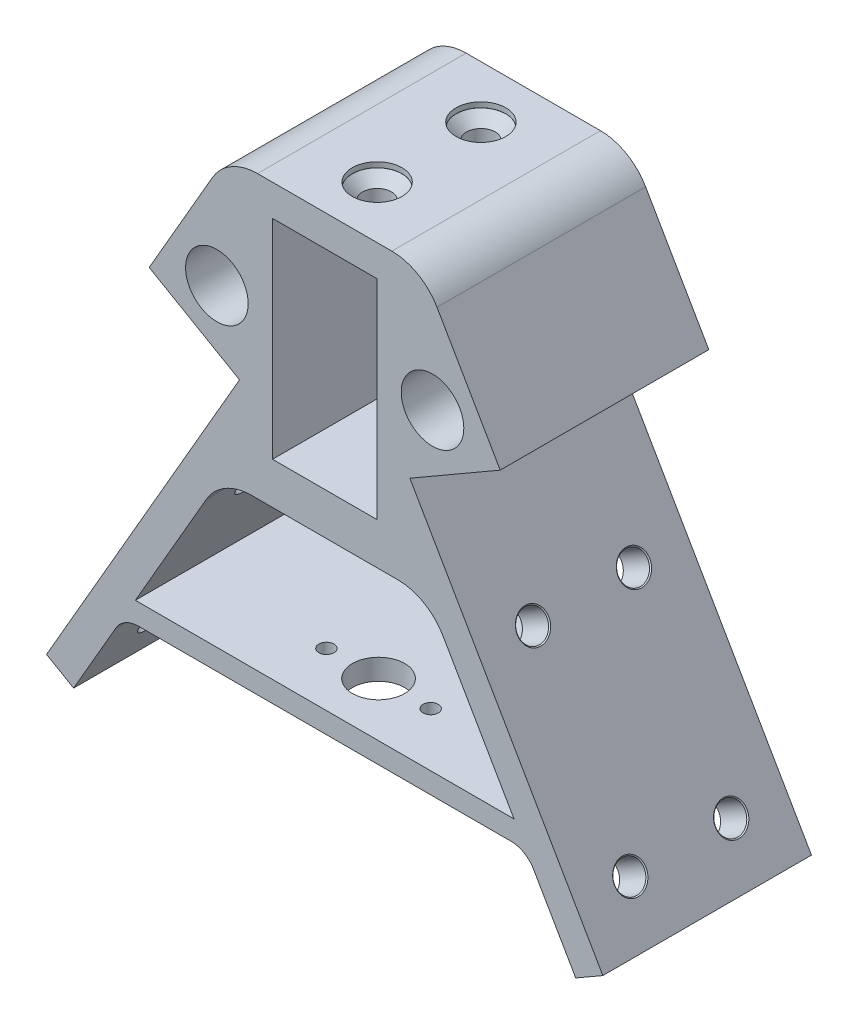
ISO-10303-21;
HEADER;
FILE_DESCRIPTION(('STEP AP214'),'2;1');
FILE_NAME('part.step','',(''),(''),'','','');
FILE_SCHEMA(('AUTOMOTIVE_DESIGN { 1 0 10303 214 1 1 1 1 }'));
ENDSEC;
DATA;
#1=APPLICATION_CONTEXT('core data for automotive mechanical design processes');
#2=APPLICATION_PROTOCOL_DEFINITION('international standard','automotive_design',2000,#1);
#3=PRODUCT_CONTEXT('',#1,'mechanical');
#4=PRODUCT('Part','Part','',(#3));
#5=PRODUCT_RELATED_PRODUCT_CATEGORY('part','',(#4));
#6=PRODUCT_DEFINITION_FORMATION('','',#4);
#7=PRODUCT_DEFINITION_CONTEXT('part definition',#1,'design');
#8=PRODUCT_DEFINITION('design','',#6,#7);
#9=PRODUCT_DEFINITION_SHAPE('','',#8);
#10=(LENGTH_UNIT() NAMED_UNIT(*) SI_UNIT(.MILLI.,.METRE.));
#11=(NAMED_UNIT(*) PLANE_ANGLE_UNIT() SI_UNIT($,.RADIAN.));
#12=(NAMED_UNIT(*) SI_UNIT($,.STERADIAN.) SOLID_ANGLE_UNIT());
#13=UNCERTAINTY_MEASURE_WITH_UNIT(LENGTH_MEASURE(1.E-05),#10,'distance_accuracy_value','');
#14=(GEOMETRIC_REPRESENTATION_CONTEXT(3) GLOBAL_UNCERTAINTY_ASSIGNED_CONTEXT((#13)) GLOBAL_UNIT_ASSIGNED_CONTEXT((#10,
#11,#12)) REPRESENTATION_CONTEXT('',''));
#15=CARTESIAN_POINT('',(0.,0.,0.));
#16=DIRECTION('',(0.,0.,1.));
#17=DIRECTION('',(1.,0.,0.));
#18=AXIS2_PLACEMENT_3D('',#15,#16,#17);
#19=CARTESIAN_POINT('',(-2.05564532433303,-49.9061272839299,-9.52228378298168));
#20=DIRECTION('',(0.,1.,0.));
#21=DIRECTION('',(-1.,0.,0.));
#22=AXIS2_PLACEMENT_3D('',#19,#20,#21);
#23=CYLINDRICAL_SURFACE('',#22,2.75);
#24=CARTESIAN_POINT('',(-2.05564532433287,50.1615147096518,-9.52228378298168));
#25=DIRECTION('',(0.,1.,0.));
#26=DIRECTION('',(-1.,0.,0.));
#27=AXIS2_PLACEMENT_3D('',#24,#25,#26);
#28=CIRCLE('',#27,2.75);
#29=CARTESIAN_POINT('',(-4.80564532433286,50.1615147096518,-9.52228378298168));
#30=VERTEX_POINT('',#29);
#31=EDGE_CURVE('E283',#30,#30,#28,.T.);
#32=ORIENTED_EDGE('',*,*,#31,.T.);
#33=EDGE_LOOP('',(#32));
#34=FACE_BOUND('',#33,.T.);
#35=CARTESIAN_POINT('',(-2.05564532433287,47.1615147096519,-9.52228378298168));
#36=DIRECTION('',(0.,1.,0.));
#37=DIRECTION('',(0.,0.,1.));
#38=AXIS2_PLACEMENT_3D('',#35,#36,#37);
#39=CIRCLE('',#38,2.75);
#40=CARTESIAN_POINT('',(-2.05564532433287,47.1615147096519,-6.77228378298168));
#41=VERTEX_POINT('',#40);
#42=EDGE_CURVE('E504',#41,#41,#39,.F.);
#43=ORIENTED_EDGE('',*,*,#42,.T.);
#44=EDGE_LOOP('',(#43));
#45=FACE_BOUND('',#44,.T.);
#46=ADVANCED_FACE('F16',(#34,#45),#23,.F.);
#47=CARTESIAN_POINT('',(-2.05564532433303,-49.9061272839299,10.3777162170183));
#48=DIRECTION('',(0.,1.,0.));
#49=DIRECTION('',(-1.,0.,0.));
#50=AXIS2_PLACEMENT_3D('',#47,#48,#49);
#51=CYLINDRICAL_SURFACE('',#50,2.75);
#52=CARTESIAN_POINT('',(-2.05564532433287,50.1615147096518,10.3777162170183));
#53=DIRECTION('',(0.,1.,0.));
#54=DIRECTION('',(-1.,0.,0.));
#55=AXIS2_PLACEMENT_3D('',#52,#53,#54);
#56=CIRCLE('',#55,2.75);
#57=CARTESIAN_POINT('',(-4.80564532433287,50.1615147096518,10.3777162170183));
#58=VERTEX_POINT('',#57);
#59=EDGE_CURVE('E289',#58,#58,#56,.T.);
#60=ORIENTED_EDGE('',*,*,#59,.T.);
#61=EDGE_LOOP('',(#60));
#62=FACE_BOUND('',#61,.T.);
#63=CARTESIAN_POINT('',(-2.05564532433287,47.1615147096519,10.3777162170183));
#64=DIRECTION('',(0.,1.,0.));
#65=DIRECTION('',(0.,0.,1.));
#66=AXIS2_PLACEMENT_3D('',#63,#64,#65);
#67=CIRCLE('',#66,2.75);
#68=CARTESIAN_POINT('',(-2.05564532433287,47.1615147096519,13.1277162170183));
#69=VERTEX_POINT('',#68);
#70=EDGE_CURVE('E513',#69,#69,#67,.F.);
#71=ORIENTED_EDGE('',*,*,#70,.T.);
#72=EDGE_LOOP('',(#71));
#73=FACE_BOUND('',#72,.T.);
#74=ADVANCED_FACE('F331',(#62,#73),#51,.F.);
#75=CARTESIAN_POINT('',(11.9755525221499,-10.8384852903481,20.4277162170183));
#76=DIRECTION('',(0.,0.,-1.));
#77=DIRECTION('',(-1.,0.,0.));
#78=AXIS2_PLACEMENT_3D('',#75,#76,#77);
#79=CYLINDRICAL_SURFACE('',#78,10.);
#80=CARTESIAN_POINT('',(11.9755525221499,-10.8384852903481,-19.5722837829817));
#81=DIRECTION('',(0.,0.,1.));
#82=DIRECTION('',(1.,0.,0.));
#83=AXIS2_PLACEMENT_3D('',#80,#81,#82);
#84=CIRCLE('',#83,10.);
#85=CARTESIAN_POINT('',(20.6358065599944,-5.83848529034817,-19.5722837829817));
#86=VERTEX_POINT('',#85);
#87=CARTESIAN_POINT('',(11.9755525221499,-0.838485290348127,-19.5722837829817));
#88=VERTEX_POINT('',#87);
#89=EDGE_CURVE('E633',#86,#88,#84,.T.);
#90=ORIENTED_EDGE('',*,*,#89,.F.);
#91=DIRECTION('',(0.,0.,-1.));
#92=VECTOR('',#91,1.);
#93=CARTESIAN_POINT('',(20.6358065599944,-5.83848529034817,20.4277162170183));
#94=LINE('',#93,#92);
#95=CARTESIAN_POINT('',(20.6358065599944,-5.83848529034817,20.4277162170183));
#96=VERTEX_POINT('',#95);
#97=EDGE_CURVE('E230',#96,#86,#94,.T.);
#98=ORIENTED_EDGE('',*,*,#97,.F.);
#99=CARTESIAN_POINT('',(11.9755525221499,-10.8384852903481,20.4277162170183));
#100=DIRECTION('',(0.,0.,1.));
#101=DIRECTION('',(1.,0.,0.));
#102=AXIS2_PLACEMENT_3D('',#99,#100,#101);
#103=CIRCLE('',#102,10.);
#104=CARTESIAN_POINT('',(11.9755525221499,-0.838485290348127,20.4277162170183));
#105=VERTEX_POINT('',#104);
#106=EDGE_CURVE('E569',#96,#105,#103,.T.);
#107=ORIENTED_EDGE('',*,*,#106,.T.);
#108=DIRECTION('',(0.,0.,-1.));
#109=VECTOR('',#108,1.);
#110=CARTESIAN_POINT('',(11.9755525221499,-0.838485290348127,20.4277162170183));
#111=LINE('',#110,#109);
#112=EDGE_CURVE('E122',#105,#88,#111,.T.);
#113=ORIENTED_EDGE('',*,*,#112,.T.);
#114=EDGE_LOOP('',(#90,#98,#107,#113));
#115=FACE_BOUND('',#114,.T.);
#116=ADVANCED_FACE('F337',(#115),#79,.F.);
#117=CARTESIAN_POINT('',(32.7453211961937,-26.8127798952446,20.4277162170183));
#118=DIRECTION('',(-0.86602540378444,-0.499999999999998,0.));
#119=DIRECTION('',(0.499999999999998,-0.86602540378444,0.));
#120=AXIS2_PLACEMENT_3D('',#117,#118,#119);
#121=PLANE('',#120);
#122=CARTESIAN_POINT('',(22.3651941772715,-8.83387250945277,-9.24728378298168));
#123=DIRECTION('',(-0.866025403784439,-0.499999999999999,0.));
#124=DIRECTION('',(0.499999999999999,-0.866025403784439,0.));
#125=AXIS2_PLACEMENT_3D('',#122,#123,#124);
#126=CIRCLE('',#125,2.825);
#127=CARTESIAN_POINT('',(23.7776941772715,-11.2803942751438,-9.24728378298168));
#128=VERTEX_POINT('',#127);
#129=EDGE_CURVE('E829',#128,#128,#126,.F.);
#130=ORIENTED_EDGE('',*,*,#129,.T.);
#131=EDGE_LOOP('',(#130));
#132=FACE_BOUND('',#131,.T.);
#133=CARTESIAN_POINT('',(22.3651941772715,-8.83387250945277,10.1027162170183));
#134=DIRECTION('',(-0.866025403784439,-0.499999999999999,0.));
#135=DIRECTION('',(0.499999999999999,-0.866025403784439,0.));
#136=AXIS2_PLACEMENT_3D('',#133,#134,#135);
#137=CIRCLE('',#136,2.82500000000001);
#138=CARTESIAN_POINT('',(23.7776941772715,-11.2803942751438,10.1027162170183));
#139=VERTEX_POINT('',#138);
#140=EDGE_CURVE('E493',#139,#139,#137,.F.);
#141=ORIENTED_EDGE('',*,*,#140,.T.);
#142=EDGE_LOOP('',(#141));
#143=FACE_BOUND('',#142,.T.);
#144=DIRECTION('',(-0.499999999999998,0.86602540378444,0.));
#145=VECTOR('',#144,1.);
#146=CARTESIAN_POINT('',(32.7453211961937,-26.8127798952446,-19.5722837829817));
#147=LINE('',#146,#145);
#148=CARTESIAN_POINT('',(34.2420136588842,-29.4051272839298,-19.5722837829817));
#149=VERTEX_POINT('',#148);
#150=EDGE_CURVE('E635',#149,#86,#147,.T.);
#151=ORIENTED_EDGE('',*,*,#150,.F.);
#152=DIRECTION('',(0.,0.,-1.));
#153=VECTOR('',#152,1.);
#154=CARTESIAN_POINT('',(34.2420136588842,-29.4051272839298,20.4277162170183));
#155=LINE('',#154,#153);
#156=CARTESIAN_POINT('',(34.2420136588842,-29.4051272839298,20.4277162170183));
#157=VERTEX_POINT('',#156);
#158=EDGE_CURVE('E224',#157,#149,#155,.T.);
#159=ORIENTED_EDGE('',*,*,#158,.F.);
#160=DIRECTION('',(-0.499999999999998,0.86602540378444,0.));
#161=VECTOR('',#160,1.);
#162=CARTESIAN_POINT('',(32.7453211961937,-26.8127798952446,20.4277162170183));
#163=LINE('',#162,#161);
#164=EDGE_CURVE('E571',#157,#96,#163,.T.);
#165=ORIENTED_EDGE('',*,*,#164,.T.);
#166=ORIENTED_EDGE('',*,*,#97,.T.);
#167=EDGE_LOOP('',(#151,#159,#165,#166));
#168=FACE_BOUND('',#167,.T.);
#169=ADVANCED_FACE('F375',(#132,#143,#168),#121,.T.);
#170=CARTESIAN_POINT('',(-2.05564532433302,-29.4051272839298,20.4277162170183));
#171=DIRECTION('',(0.,1.,0.));
#172=DIRECTION('',(0.,0.,1.));
#173=AXIS2_PLACEMENT_3D('',#170,#171,#172);
#174=PLANE('',#173);
#175=CARTESIAN_POINT('',(7.94435467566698,-29.4051272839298,10.1027162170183));
#176=DIRECTION('',(0.,1.,0.));
#177=DIRECTION('',(0.,0.,1.));
#178=AXIS2_PLACEMENT_3D('',#175,#176,#177);
#179=CIRCLE('',#178,1.45);
#180=CARTESIAN_POINT('',(7.94435467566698,-29.4051272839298,11.5527162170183));
#181=VERTEX_POINT('',#180);
#182=EDGE_CURVE('E807',#181,#181,#179,.F.);
#183=ORIENTED_EDGE('',*,*,#182,.T.);
#184=EDGE_LOOP('',(#183));
#185=FACE_BOUND('',#184,.T.);
#186=CARTESIAN_POINT('',(-12.055645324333,-29.4051272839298,10.1027162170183));
#187=DIRECTION('',(0.,1.,0.));
#188=DIRECTION('',(0.,0.,1.));
#189=AXIS2_PLACEMENT_3D('',#186,#187,#188);
#190=CIRCLE('',#189,1.45);
#191=CARTESIAN_POINT('',(-12.055645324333,-29.4051272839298,11.5527162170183));
#192=VERTEX_POINT('',#191);
#193=EDGE_CURVE('E815',#192,#192,#190,.F.);
#194=ORIENTED_EDGE('',*,*,#193,.T.);
#195=EDGE_LOOP('',(#194));
#196=FACE_BOUND('',#195,.T.);
#197=CARTESIAN_POINT('',(-2.05564532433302,-29.4051272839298,10.1027162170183));
#198=DIRECTION('',(0.,1.,0.));
#199=DIRECTION('',(0.,0.,1.));
#200=AXIS2_PLACEMENT_3D('',#197,#198,#199);
#201=CIRCLE('',#200,5.);
#202=CARTESIAN_POINT('',(-2.05564532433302,-29.4051272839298,15.1027162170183));
#203=VERTEX_POINT('',#202);
#204=EDGE_CURVE('E817',#203,#203,#201,.F.);
#205=ORIENTED_EDGE('',*,*,#204,.T.);
#206=EDGE_LOOP('',(#205));
#207=FACE_BOUND('',#206,.T.);
#208=DIRECTION('',(1.,0.,0.));
#209=VECTOR('',#208,1.);
#210=CARTESIAN_POINT('',(-2.05564532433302,-29.4051272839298,-19.5722837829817));
#211=LINE('',#210,#209);
#212=CARTESIAN_POINT('',(-38.3533043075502,-29.4051272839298,-19.5722837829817));
#213=VERTEX_POINT('',#212);
#214=EDGE_CURVE('E638',#213,#149,#211,.T.);
#215=ORIENTED_EDGE('',*,*,#214,.F.);
#216=DIRECTION('',(0.,0.,-1.));
#217=VECTOR('',#216,1.);
#218=CARTESIAN_POINT('',(-38.3533043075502,-29.4051272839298,20.4277162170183));
#219=LINE('',#218,#217);
#220=CARTESIAN_POINT('',(-38.3533043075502,-29.4051272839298,20.4277162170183));
#221=VERTEX_POINT('',#220);
#222=EDGE_CURVE('E222',#221,#213,#219,.T.);
#223=ORIENTED_EDGE('',*,*,#222,.F.);
#224=DIRECTION('',(1.,0.,0.));
#225=VECTOR('',#224,1.);
#226=CARTESIAN_POINT('',(-2.05564532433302,-29.4051272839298,20.4277162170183));
#227=LINE('',#226,#225);
#228=EDGE_CURVE('E216',#221,#157,#227,.T.);
#229=ORIENTED_EDGE('',*,*,#228,.T.);
#230=ORIENTED_EDGE('',*,*,#158,.T.);
#231=EDGE_LOOP('',(#215,#223,#229,#230));
#232=FACE_BOUND('',#231,.T.);
#233=ADVANCED_FACE('F371',(#185,#196,#207,#232),#174,.T.);
#234=CARTESIAN_POINT('',(-36.8566118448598,-26.8127798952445,20.4277162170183));
#235=DIRECTION('',(-0.866025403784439,0.499999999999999,0.));
#236=DIRECTION('',(-0.499999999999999,-0.866025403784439,0.));
#237=AXIS2_PLACEMENT_3D('',#234,#235,#236);
#238=PLANE('',#237);
#239=CARTESIAN_POINT('',(-26.4764848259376,-8.83387250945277,10.1027162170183));
#240=DIRECTION('',(-0.866025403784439,0.499999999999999,0.));
#241=DIRECTION('',(-0.499999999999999,-0.866025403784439,0.));
#242=AXIS2_PLACEMENT_3D('',#239,#240,#241);
#243=CIRCLE('',#242,2.82500000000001);
#244=CARTESIAN_POINT('',(-27.8889848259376,-11.2803942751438,10.1027162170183));
#245=VERTEX_POINT('',#244);
#246=EDGE_CURVE('E486',#245,#245,#243,.F.);
#247=ORIENTED_EDGE('',*,*,#246,.F.);
#248=EDGE_LOOP('',(#247));
#249=FACE_BOUND('',#248,.T.);
#250=CARTESIAN_POINT('',(-26.4764848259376,-8.83387250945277,-9.24728378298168));
#251=DIRECTION('',(-0.866025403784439,0.499999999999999,0.));
#252=DIRECTION('',(-0.499999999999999,-0.866025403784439,0.));
#253=AXIS2_PLACEMENT_3D('',#250,#251,#252);
#254=CIRCLE('',#253,2.825);
#255=CARTESIAN_POINT('',(-27.8889848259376,-11.2803942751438,-9.24728378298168));
#256=VERTEX_POINT('',#255);
#257=EDGE_CURVE('E490',#256,#256,#254,.F.);
#258=ORIENTED_EDGE('',*,*,#257,.F.);
#259=EDGE_LOOP('',(#258));
#260=FACE_BOUND('',#259,.T.);
#261=DIRECTION('',(0.499999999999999,0.866025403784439,0.));
#262=VECTOR('',#261,1.);
#263=CARTESIAN_POINT('',(-36.8566118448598,-26.8127798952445,-19.5722837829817));
#264=LINE('',#263,#262);
#265=CARTESIAN_POINT('',(-24.7470972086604,-5.83848529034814,-19.5722837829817));
#266=VERTEX_POINT('',#265);
#267=EDGE_CURVE('E221',#213,#266,#264,.T.);
#268=ORIENTED_EDGE('',*,*,#267,.T.);
#269=DIRECTION('',(0.,0.,-1.));
#270=VECTOR('',#269,1.);
#271=CARTESIAN_POINT('',(-24.7470972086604,-5.83848529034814,20.4277162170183));
#272=LINE('',#271,#270);
#273=CARTESIAN_POINT('',(-24.7470972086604,-5.83848529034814,20.4277162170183));
#274=VERTEX_POINT('',#273);
#275=EDGE_CURVE('E205',#274,#266,#272,.T.);
#276=ORIENTED_EDGE('',*,*,#275,.F.);
#277=DIRECTION('',(0.499999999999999,0.866025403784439,0.));
#278=VECTOR('',#277,1.);
#279=CARTESIAN_POINT('',(-36.8566118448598,-26.8127798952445,20.4277162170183));
#280=LINE('',#279,#278);
#281=EDGE_CURVE('E208',#221,#274,#280,.T.);
#282=ORIENTED_EDGE('',*,*,#281,.F.);
#283=ORIENTED_EDGE('',*,*,#222,.T.);
#284=EDGE_LOOP('',(#268,#276,#282,#283));
#285=FACE_BOUND('',#284,.T.);
#286=ADVANCED_FACE('F219',(#249,#260,#285),#238,.F.);
#287=CARTESIAN_POINT('',(-16.086843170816,-10.8384852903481,20.4277162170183));
#288=DIRECTION('',(0.,0.,-1.));
#289=DIRECTION('',(-1.,0.,0.));
#290=AXIS2_PLACEMENT_3D('',#287,#288,#289);
#291=CYLINDRICAL_SURFACE('',#290,9.99999999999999);
#292=CARTESIAN_POINT('',(-16.086843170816,-10.8384852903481,-19.5722837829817));
#293=DIRECTION('',(0.,0.,1.));
#294=DIRECTION('',(1.,0.,0.));
#295=AXIS2_PLACEMENT_3D('',#292,#293,#294);
#296=CIRCLE('',#295,9.99999999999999);
#297=CARTESIAN_POINT('',(-16.086843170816,-0.83848529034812,-19.5722837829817));
#298=VERTEX_POINT('',#297);
#299=EDGE_CURVE('E642',#266,#298,#296,.F.);
#300=ORIENTED_EDGE('',*,*,#299,.T.);
#301=DIRECTION('',(0.,0.,-1.));
#302=VECTOR('',#301,1.);
#303=CARTESIAN_POINT('',(-16.086843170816,-0.83848529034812,20.4277162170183));
#304=LINE('',#303,#302);
#305=CARTESIAN_POINT('',(-16.086843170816,-0.83848529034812,20.4277162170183));
#306=VERTEX_POINT('',#305);
#307=EDGE_CURVE('E207',#306,#298,#304,.T.);
#308=ORIENTED_EDGE('',*,*,#307,.F.);
#309=CARTESIAN_POINT('',(-16.086843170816,-10.8384852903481,20.4277162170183));
#310=DIRECTION('',(0.,0.,1.));
#311=DIRECTION('',(1.,0.,0.));
#312=AXIS2_PLACEMENT_3D('',#309,#310,#311);
#313=CIRCLE('',#312,9.99999999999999);
#314=EDGE_CURVE('E200',#274,#306,#313,.F.);
#315=ORIENTED_EDGE('',*,*,#314,.F.);
#316=ORIENTED_EDGE('',*,*,#275,.T.);
#317=EDGE_LOOP('',(#300,#308,#315,#316));
#318=FACE_BOUND('',#317,.T.);
#319=ADVANCED_FACE('F203',(#318),#291,.F.);
#320=CARTESIAN_POINT('',(-2.05564532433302,47.1615147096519,20.4277162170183));
#321=DIRECTION('',(0.,1.,0.));
#322=DIRECTION('',(0.,0.,1.));
#323=AXIS2_PLACEMENT_3D('',#320,#321,#322);
#324=PLANE('',#323);
#325=ORIENTED_EDGE('',*,*,#70,.F.);
#326=EDGE_LOOP('',(#325));
#327=FACE_BOUND('',#326,.T.);
#328=ORIENTED_EDGE('',*,*,#42,.F.);
#329=EDGE_LOOP('',(#328));
#330=FACE_BOUND('',#329,.T.);
#331=DIRECTION('',(1.,0.,0.));
#332=VECTOR('',#331,1.);
#333=CARTESIAN_POINT('',(-2.05564532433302,47.1615147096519,-19.5722837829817));
#334=LINE('',#333,#332);
#335=CARTESIAN_POINT('',(-12.055645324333,47.1615147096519,-19.5722837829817));
#336=VERTEX_POINT('',#335);
#337=CARTESIAN_POINT('',(7.94435467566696,47.1615147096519,-19.5722837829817));
#338=VERTEX_POINT('',#337);
#339=EDGE_CURVE('E621',#336,#338,#334,.T.);
#340=ORIENTED_EDGE('',*,*,#339,.T.);
#341=DIRECTION('',(0.,0.,-1.));
#342=VECTOR('',#341,1.);
#343=CARTESIAN_POINT('',(7.94435467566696,47.1615147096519,20.4277162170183));
#344=LINE('',#343,#342);
#345=CARTESIAN_POINT('',(7.94435467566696,47.1615147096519,20.4277162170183));
#346=VERTEX_POINT('',#345);
#347=EDGE_CURVE('E239',#346,#338,#344,.T.);
#348=ORIENTED_EDGE('',*,*,#347,.F.);
#349=DIRECTION('',(1.,0.,0.));
#350=VECTOR('',#349,1.);
#351=CARTESIAN_POINT('',(-2.05564532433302,47.1615147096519,20.4277162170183));
#352=LINE('',#351,#350);
#353=CARTESIAN_POINT('',(-12.055645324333,47.1615147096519,20.4277162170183));
#354=VERTEX_POINT('',#353);
#355=EDGE_CURVE('E558',#354,#346,#352,.T.);
#356=ORIENTED_EDGE('',*,*,#355,.F.);
#357=DIRECTION('',(0.,0.,-1.));
#358=VECTOR('',#357,1.);
#359=CARTESIAN_POINT('',(-12.055645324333,47.1615147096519,20.4277162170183));
#360=LINE('',#359,#358);
#361=EDGE_CURVE('E233',#354,#336,#360,.T.);
#362=ORIENTED_EDGE('',*,*,#361,.T.);
#363=EDGE_LOOP('',(#340,#348,#356,#362));
#364=FACE_BOUND('',#363,.T.);
#365=ADVANCED_FACE('F368',(#327,#330,#364),#324,.F.);
#366=CARTESIAN_POINT('',(7.94435467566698,-46.9051272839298,20.4277162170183));
#367=DIRECTION('',(1.,0.,0.));
#368=DIRECTION('',(0.,1.,0.));
#369=AXIS2_PLACEMENT_3D('',#366,#367,#368);
#370=PLANE('',#369);
#371=DIRECTION('',(0.,-1.,0.));
#372=VECTOR('',#371,1.);
#373=CARTESIAN_POINT('',(7.94435467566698,-46.9051272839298,-19.5722837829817));
#374=LINE('',#373,#372);
#375=CARTESIAN_POINT('',(7.94435467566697,7.16151470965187,-19.5722837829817));
#376=VERTEX_POINT('',#375);
#377=EDGE_CURVE('E624',#338,#376,#374,.T.);
#378=ORIENTED_EDGE('',*,*,#377,.T.);
#379=DIRECTION('',(0.,0.,-1.));
#380=VECTOR('',#379,1.);
#381=CARTESIAN_POINT('',(7.94435467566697,7.16151470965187,20.4277162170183));
#382=LINE('',#381,#380);
#383=CARTESIAN_POINT('',(7.94435467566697,7.16151470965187,20.4277162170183));
#384=VERTEX_POINT('',#383);
#385=EDGE_CURVE('E237',#384,#376,#382,.T.);
#386=ORIENTED_EDGE('',*,*,#385,.F.);
#387=DIRECTION('',(0.,-1.,0.));
#388=VECTOR('',#387,1.);
#389=CARTESIAN_POINT('',(7.94435467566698,-46.9051272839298,20.4277162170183));
#390=LINE('',#389,#388);
#391=EDGE_CURVE('E561',#346,#384,#390,.T.);
#392=ORIENTED_EDGE('',*,*,#391,.F.);
#393=ORIENTED_EDGE('',*,*,#347,.T.);
#394=EDGE_LOOP('',(#378,#386,#392,#393));
#395=FACE_BOUND('',#394,.T.);
#396=ADVANCED_FACE('F389',(#395),#370,.F.);
#397=CARTESIAN_POINT('',(-2.05564532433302,7.16151470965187,20.4277162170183));
#398=DIRECTION('',(0.,1.,0.));
#399=DIRECTION('',(0.,0.,1.));
#400=AXIS2_PLACEMENT_3D('',#397,#398,#399);
#401=PLANE('',#400);
#402=DIRECTION('',(1.,0.,0.));
#403=VECTOR('',#402,1.);
#404=CARTESIAN_POINT('',(-2.05564532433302,7.16151470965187,-19.5722837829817));
#405=LINE('',#404,#403);
#406=CARTESIAN_POINT('',(-12.055645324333,7.16151470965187,-19.5722837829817));
#407=VERTEX_POINT('',#406);
#408=EDGE_CURVE('E627',#407,#376,#405,.T.);
#409=ORIENTED_EDGE('',*,*,#408,.F.);
#410=DIRECTION('',(0.,0.,-1.));
#411=VECTOR('',#410,1.);
#412=CARTESIAN_POINT('',(-12.055645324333,7.16151470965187,20.4277162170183));
#413=LINE('',#412,#411);
#414=CARTESIAN_POINT('',(-12.055645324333,7.16151470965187,20.4277162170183));
#415=VERTEX_POINT('',#414);
#416=EDGE_CURVE('E235',#415,#407,#413,.T.);
#417=ORIENTED_EDGE('',*,*,#416,.F.);
#418=DIRECTION('',(1.,0.,0.));
#419=VECTOR('',#418,1.);
#420=CARTESIAN_POINT('',(-2.05564532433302,7.16151470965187,20.4277162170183));
#421=LINE('',#420,#419);
#422=EDGE_CURVE('E563',#415,#384,#421,.T.);
#423=ORIENTED_EDGE('',*,*,#422,.T.);
#424=ORIENTED_EDGE('',*,*,#385,.T.);
#425=EDGE_LOOP('',(#409,#417,#423,#424));
#426=FACE_BOUND('',#425,.T.);
#427=ADVANCED_FACE('F385',(#426),#401,.T.);
#428=CARTESIAN_POINT('',(-37.7759540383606,-38.4051272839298,20.4277162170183));
#429=DIRECTION('',(0.,0.,-1.));
#430=DIRECTION('',(-1.,0.,0.));
#431=AXIS2_PLACEMENT_3D('',#428,#429,#430);
#432=CYLINDRICAL_SURFACE('',#431,5.);
#433=CARTESIAN_POINT('',(-37.7759540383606,-38.4051272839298,-19.5722837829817));
#434=DIRECTION('',(0.,0.,1.));
#435=DIRECTION('',(1.,0.,0.));
#436=AXIS2_PLACEMENT_3D('',#433,#434,#435);
#437=CIRCLE('',#436,5.);
#438=CARTESIAN_POINT('',(-37.7759540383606,-33.4051272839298,-19.5722837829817));
#439=VERTEX_POINT('',#438);
#440=CARTESIAN_POINT('',(-42.1060810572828,-35.9051272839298,-19.5722837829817));
#441=VERTEX_POINT('',#440);
#442=EDGE_CURVE('E516',#439,#441,#437,.T.);
#443=ORIENTED_EDGE('',*,*,#442,.F.);
#444=DIRECTION('',(0.,0.,-1.));
#445=VECTOR('',#444,1.);
#446=CARTESIAN_POINT('',(-37.7759540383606,-33.4051272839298,20.4277162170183));
#447=LINE('',#446,#445);
#448=CARTESIAN_POINT('',(-37.7759540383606,-33.4051272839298,20.4277162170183));
#449=VERTEX_POINT('',#448);
#450=EDGE_CURVE('E129',#449,#439,#447,.T.);
#451=ORIENTED_EDGE('',*,*,#450,.F.);
#452=CARTESIAN_POINT('',(-37.7759540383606,-38.4051272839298,20.4277162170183));
#453=DIRECTION('',(0.,0.,1.));
#454=DIRECTION('',(1.,0.,0.));
#455=AXIS2_PLACEMENT_3D('',#452,#453,#454);
#456=CIRCLE('',#455,5.);
#457=CARTESIAN_POINT('',(-42.1060810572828,-35.9051272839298,20.4277162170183));
#458=VERTEX_POINT('',#457);
#459=EDGE_CURVE('E519',#449,#458,#456,.T.);
#460=ORIENTED_EDGE('',*,*,#459,.T.);
#461=DIRECTION('',(0.,0.,-1.));
#462=VECTOR('',#461,1.);
#463=CARTESIAN_POINT('',(-42.1060810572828,-35.9051272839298,20.4277162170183));
#464=LINE('',#463,#462);
#465=EDGE_CURVE('E242',#458,#441,#464,.T.);
#466=ORIENTED_EDGE('',*,*,#465,.T.);
#467=EDGE_LOOP('',(#443,#451,#460,#466));
#468=FACE_BOUND('',#467,.T.);
#469=ADVANCED_FACE('F388',(#468),#432,.F.);
#470=CARTESIAN_POINT('',(-2.05564532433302,-33.4051272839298,20.4277162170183));
#471=DIRECTION('',(0.,1.,0.));
#472=DIRECTION('',(-1.,0.,0.));
#473=AXIS2_PLACEMENT_3D('',#470,#471,#472);
#474=PLANE('',#473);
#475=CARTESIAN_POINT('',(7.94435467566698,-33.4051272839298,10.1027162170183));
#476=DIRECTION('',(0.,-1.,0.));
#477=DIRECTION('',(1.,0.,0.));
#478=AXIS2_PLACEMENT_3D('',#475,#476,#477);
#479=CIRCLE('',#478,1.45);
#480=CARTESIAN_POINT('',(9.39435467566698,-33.4051272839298,10.1027162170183));
#481=VERTEX_POINT('',#480);
#482=EDGE_CURVE('E803',#481,#481,#479,.T.);
#483=ORIENTED_EDGE('',*,*,#482,.F.);
#484=EDGE_LOOP('',(#483));
#485=FACE_BOUND('',#484,.T.);
#486=CARTESIAN_POINT('',(-12.055645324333,-33.4051272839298,10.1027162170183));
#487=DIRECTION('',(0.,-1.,0.));
#488=DIRECTION('',(1.,0.,0.));
#489=AXIS2_PLACEMENT_3D('',#486,#487,#488);
#490=CIRCLE('',#489,1.45);
#491=CARTESIAN_POINT('',(-10.605645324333,-33.4051272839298,10.1027162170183));
#492=VERTEX_POINT('',#491);
#493=EDGE_CURVE('E812',#492,#492,#490,.T.);
#494=ORIENTED_EDGE('',*,*,#493,.F.);
#495=EDGE_LOOP('',(#494));
#496=FACE_BOUND('',#495,.T.);
#497=CARTESIAN_POINT('',(-2.05564532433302,-33.4051272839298,10.1027162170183));
#498=DIRECTION('',(0.,-1.,0.));
#499=DIRECTION('',(1.,0.,0.));
#500=AXIS2_PLACEMENT_3D('',#497,#498,#499);
#501=CIRCLE('',#500,5.);
#502=CARTESIAN_POINT('',(2.94435467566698,-33.4051272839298,10.1027162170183));
#503=VERTEX_POINT('',#502);
#504=EDGE_CURVE('E823',#503,#503,#501,.T.);
#505=ORIENTED_EDGE('',*,*,#504,.F.);
#506=EDGE_LOOP('',(#505));
#507=FACE_BOUND('',#506,.T.);
#508=DIRECTION('',(1.,0.,0.));
#509=VECTOR('',#508,1.);
#510=CARTESIAN_POINT('',(-2.05564532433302,-33.4051272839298,-19.5722837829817));
#511=LINE('',#510,#509);
#512=CARTESIAN_POINT('',(33.6646633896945,-33.4051272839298,-19.5722837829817));
#513=VERTEX_POINT('',#512);
#514=EDGE_CURVE('E583',#439,#513,#511,.T.);
#515=ORIENTED_EDGE('',*,*,#514,.T.);
#516=DIRECTION('',(0.,0.,-1.));
#517=VECTOR('',#516,1.);
#518=CARTESIAN_POINT('',(33.6646633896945,-33.4051272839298,20.4277162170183));
#519=LINE('',#518,#517);
#520=CARTESIAN_POINT('',(33.6646633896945,-33.4051272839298,20.4277162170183));
#521=VERTEX_POINT('',#520);
#522=EDGE_CURVE('E277',#521,#513,#519,.T.);
#523=ORIENTED_EDGE('',*,*,#522,.F.);
#524=DIRECTION('',(1.,0.,0.));
#525=VECTOR('',#524,1.);
#526=CARTESIAN_POINT('',(-2.05564532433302,-33.4051272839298,20.4277162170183));
#527=LINE('',#526,#525);
#528=EDGE_CURVE('E521',#449,#521,#527,.T.);
#529=ORIENTED_EDGE('',*,*,#528,.F.);
#530=ORIENTED_EDGE('',*,*,#450,.T.);
#531=EDGE_LOOP('',(#515,#523,#529,#530));
#532=FACE_BOUND('',#531,.T.);
#533=ADVANCED_FACE('F450',(#485,#496,#507,#532),#474,.F.);
#534=CARTESIAN_POINT('',(33.6646633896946,-38.4051272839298,20.4277162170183));
#535=DIRECTION('',(0.,0.,-1.));
#536=DIRECTION('',(-1.,0.,0.));
#537=AXIS2_PLACEMENT_3D('',#534,#535,#536);
#538=CYLINDRICAL_SURFACE('',#537,5.);
#539=CARTESIAN_POINT('',(33.6646633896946,-38.4051272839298,-19.5722837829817));
#540=DIRECTION('',(0.,0.,1.));
#541=DIRECTION('',(1.,0.,0.));
#542=AXIS2_PLACEMENT_3D('',#539,#540,#541);
#543=CIRCLE('',#542,5.);
#544=CARTESIAN_POINT('',(37.9947904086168,-35.9051272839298,-19.5722837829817));
#545=VERTEX_POINT('',#544);
#546=EDGE_CURVE('E585',#513,#545,#543,.F.);
#547=ORIENTED_EDGE('',*,*,#546,.T.);
#548=DIRECTION('',(0.,0.,-1.));
#549=VECTOR('',#548,1.);
#550=CARTESIAN_POINT('',(37.9947904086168,-35.9051272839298,20.4277162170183));
#551=LINE('',#550,#549);
#552=CARTESIAN_POINT('',(37.9947904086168,-35.9051272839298,20.4277162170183));
#553=VERTEX_POINT('',#552);
#554=EDGE_CURVE('E275',#553,#545,#551,.T.);
#555=ORIENTED_EDGE('',*,*,#554,.F.);
#556=CARTESIAN_POINT('',(33.6646633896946,-38.4051272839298,20.4277162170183));
#557=DIRECTION('',(0.,0.,1.));
#558=DIRECTION('',(1.,0.,0.));
#559=AXIS2_PLACEMENT_3D('',#556,#557,#558);
#560=CIRCLE('',#559,5.);
#561=EDGE_CURVE('E524',#521,#553,#560,.F.);
#562=ORIENTED_EDGE('',*,*,#561,.F.);
#563=ORIENTED_EDGE('',*,*,#522,.T.);
#564=EDGE_LOOP('',(#547,#555,#562,#563));
#565=FACE_BOUND('',#564,.T.);
#566=ADVANCED_FACE('F446',(#565),#538,.F.);
#567=CARTESIAN_POINT('',(32.7453211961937,-26.8127798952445,20.4277162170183));
#568=DIRECTION('',(-0.866025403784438,-0.500000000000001,0.));
#569=DIRECTION('',(0.500000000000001,-0.866025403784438,0.));
#570=AXIS2_PLACEMENT_3D('',#567,#568,#569);
#571=PLANE('',#570);
#572=CARTESIAN_POINT('',(41.0151941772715,-41.1366200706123,-9.24728378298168));
#573=DIRECTION('',(-0.866025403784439,-0.499999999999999,0.));
#574=DIRECTION('',(0.499999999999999,-0.86602540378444,0.));
#575=AXIS2_PLACEMENT_3D('',#572,#573,#574);
#576=CIRCLE('',#575,2.825);
#577=CARTESIAN_POINT('',(42.4276941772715,-43.5831418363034,-9.24728378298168));
#578=VERTEX_POINT('',#577);
#579=EDGE_CURVE('E838',#578,#578,#576,.F.);
#580=ORIENTED_EDGE('',*,*,#579,.T.);
#581=EDGE_LOOP('',(#580));
#582=FACE_BOUND('',#581,.T.);
#583=CARTESIAN_POINT('',(41.0151941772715,-41.1366200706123,10.1027162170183));
#584=DIRECTION('',(-0.866025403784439,-0.499999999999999,0.));
#585=DIRECTION('',(0.499999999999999,-0.86602540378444,0.));
#586=AXIS2_PLACEMENT_3D('',#583,#584,#585);
#587=CIRCLE('',#586,2.825);
#588=CARTESIAN_POINT('',(42.4276941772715,-43.5831418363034,10.1027162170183));
#589=VERTEX_POINT('',#588);
#590=EDGE_CURVE('E847',#589,#589,#587,.F.);
#591=ORIENTED_EDGE('',*,*,#590,.T.);
#592=EDGE_LOOP('',(#591));
#593=FACE_BOUND('',#592,.T.);
#594=DIRECTION('',(-0.500000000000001,0.866025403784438,0.));
#595=VECTOR('',#594,1.);
#596=CARTESIAN_POINT('',(32.7453211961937,-26.8127798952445,-19.5722837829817));
#597=LINE('',#596,#595);
#598=CARTESIAN_POINT('',(46.0776941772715,-49.9051272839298,-19.5722837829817));
#599=VERTEX_POINT('',#598);
#600=EDGE_CURVE('E588',#599,#545,#597,.T.);
#601=ORIENTED_EDGE('',*,*,#600,.F.);
#602=DIRECTION('',(0.,0.,-1.));
#603=VECTOR('',#602,1.);
#604=CARTESIAN_POINT('',(46.0776941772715,-49.9051272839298,20.4277162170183));
#605=LINE('',#604,#603);
#606=CARTESIAN_POINT('',(46.0776941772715,-49.9051272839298,20.4277162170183));
#607=VERTEX_POINT('',#606);
#608=EDGE_CURVE('E273',#607,#599,#605,.T.);
#609=ORIENTED_EDGE('',*,*,#608,.F.);
#610=DIRECTION('',(-0.500000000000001,0.866025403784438,0.));
#611=VECTOR('',#610,1.);
#612=CARTESIAN_POINT('',(32.7453211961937,-26.8127798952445,20.4277162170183));
#613=LINE('',#612,#611);
#614=EDGE_CURVE('E526',#607,#553,#613,.T.);
#615=ORIENTED_EDGE('',*,*,#614,.T.);
#616=ORIENTED_EDGE('',*,*,#554,.T.);
#617=EDGE_LOOP('',(#601,#609,#615,#616));
#618=FACE_BOUND('',#617,.T.);
#619=ADVANCED_FACE('F442',(#582,#593,#618),#571,.T.);
#620=CARTESIAN_POINT('',(11.2767276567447,-69.997474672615,20.4277162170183));
#621=DIRECTION('',(0.499999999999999,-0.866025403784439,0.));
#622=DIRECTION('',(0.866025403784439,0.499999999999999,0.));
#623=AXIS2_PLACEMENT_3D('',#620,#621,#622);
#624=PLANE('',#623);
#625=DIRECTION('',(-0.866025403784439,-0.499999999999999,0.));
#626=VECTOR('',#625,1.);
#627=CARTESIAN_POINT('',(11.2767276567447,-69.997474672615,-19.5722837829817));
#628=LINE('',#627,#626);
#629=CARTESIAN_POINT('',(51.2738465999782,-46.9051272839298,-19.5722837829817));
#630=VERTEX_POINT('',#629);
#631=EDGE_CURVE('E591',#630,#599,#628,.T.);
#632=ORIENTED_EDGE('',*,*,#631,.F.);
#633=DIRECTION('',(0.,0.,-1.));
#634=VECTOR('',#633,1.);
#635=CARTESIAN_POINT('',(51.2738465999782,-46.9051272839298,20.4277162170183));
#636=LINE('',#635,#634);
#637=CARTESIAN_POINT('',(51.2738465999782,-46.9051272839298,20.4277162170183));
#638=VERTEX_POINT('',#637);
#639=EDGE_CURVE('E271',#638,#630,#636,.T.);
#640=ORIENTED_EDGE('',*,*,#639,.F.);
#641=DIRECTION('',(-0.866025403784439,-0.499999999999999,0.));
#642=VECTOR('',#641,1.);
#643=CARTESIAN_POINT('',(11.2767276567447,-69.997474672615,20.4277162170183));
#644=LINE('',#643,#642);
#645=EDGE_CURVE('E529',#638,#607,#644,.T.);
#646=ORIENTED_EDGE('',*,*,#645,.T.);
#647=ORIENTED_EDGE('',*,*,#608,.T.);
#648=EDGE_LOOP('',(#632,#640,#646,#647));
#649=FACE_BOUND('',#648,.T.);
#650=ADVANCED_FACE('F438',(#649),#624,.T.);
#651=CARTESIAN_POINT('',(37.9414736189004,-23.8127798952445,20.4277162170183));
#652=DIRECTION('',(0.866025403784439,0.5,0.));
#653=DIRECTION('',(-0.5,0.866025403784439,0.));
#654=AXIS2_PLACEMENT_3D('',#651,#652,#653);
#655=PLANE('',#654);
#656=CARTESIAN_POINT('',(27.5613465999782,-5.83387250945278,-9.24728378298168));
#657=DIRECTION('',(0.866025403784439,0.5,0.));
#658=DIRECTION('',(-0.5,0.866025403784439,0.));
#659=AXIS2_PLACEMENT_3D('',#656,#657,#658);
#660=CIRCLE('',#659,3.02500000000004);
#661=CARTESIAN_POINT('',(26.0488465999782,-3.21414566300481,-9.24728378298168));
#662=VERTEX_POINT('',#661);
#663=EDGE_CURVE('E826',#662,#662,#660,.T.);
#664=ORIENTED_EDGE('',*,*,#663,.F.);
#665=EDGE_LOOP('',(#664));
#666=FACE_BOUND('',#665,.T.);
#667=CARTESIAN_POINT('',(46.2113465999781,-38.1366200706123,-9.24728378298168));
#668=DIRECTION('',(0.866025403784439,0.5,0.));
#669=DIRECTION('',(-0.5,0.866025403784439,0.));
#670=AXIS2_PLACEMENT_3D('',#667,#668,#669);
#671=CIRCLE('',#670,3.02499999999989);
#672=CARTESIAN_POINT('',(44.6988465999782,-35.5168932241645,-9.24728378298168));
#673=VERTEX_POINT('',#672);
#674=EDGE_CURVE('E835',#673,#673,#671,.T.);
#675=ORIENTED_EDGE('',*,*,#674,.F.);
#676=EDGE_LOOP('',(#675));
#677=FACE_BOUND('',#676,.T.);
#678=CARTESIAN_POINT('',(46.2113465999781,-38.1366200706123,10.1027162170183));
#679=DIRECTION('',(0.866025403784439,0.5,0.));
#680=DIRECTION('',(-0.5,0.866025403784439,0.));
#681=AXIS2_PLACEMENT_3D('',#678,#679,#680);
#682=CIRCLE('',#681,3.02499999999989);
#683=CARTESIAN_POINT('',(44.6988465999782,-35.5168932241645,10.1027162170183));
#684=VERTEX_POINT('',#683);
#685=EDGE_CURVE('E844',#684,#684,#682,.T.);
#686=ORIENTED_EDGE('',*,*,#685,.F.);
#687=EDGE_LOOP('',(#686));
#688=FACE_BOUND('',#687,.T.);
#689=CARTESIAN_POINT('',(27.5613465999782,-5.83387250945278,10.1027162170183));
#690=DIRECTION('',(0.866025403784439,0.5,0.));
#691=DIRECTION('',(-0.5,0.866025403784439,0.));
#692=AXIS2_PLACEMENT_3D('',#689,#690,#691);
#693=CIRCLE('',#692,3.02499999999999);
#694=CARTESIAN_POINT('',(26.0488465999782,-3.21414566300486,10.1027162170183));
#695=VERTEX_POINT('',#694);
#696=EDGE_CURVE('E853',#695,#695,#693,.T.);
#697=ORIENTED_EDGE('',*,*,#696,.F.);
#698=EDGE_LOOP('',(#697));
#699=FACE_BOUND('',#698,.T.);
#700=DIRECTION('',(0.5,-0.866025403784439,0.));
#701=VECTOR('',#700,1.);
#702=CARTESIAN_POINT('',(37.9414736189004,-23.8127798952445,-19.5722837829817));
#703=LINE('',#702,#701);
#704=CARTESIAN_POINT('',(14.2738465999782,17.1807525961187,-19.5722837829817));
#705=VERTEX_POINT('',#704);
#706=EDGE_CURVE('E594',#705,#630,#703,.T.);
#707=ORIENTED_EDGE('',*,*,#706,.F.);
#708=DIRECTION('',(0.,0.,-1.));
#709=VECTOR('',#708,1.);
#710=CARTESIAN_POINT('',(14.2738465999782,17.1807525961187,20.4277162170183));
#711=LINE('',#710,#709);
#712=CARTESIAN_POINT('',(14.2738465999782,17.1807525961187,20.4277162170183));
#713=VERTEX_POINT('',#712);
#714=EDGE_CURVE('E269',#713,#705,#711,.T.);
#715=ORIENTED_EDGE('',*,*,#714,.F.);
#716=DIRECTION('',(0.5,-0.866025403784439,0.));
#717=VECTOR('',#716,1.);
#718=CARTESIAN_POINT('',(37.9414736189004,-23.8127798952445,20.4277162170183));
#719=LINE('',#718,#717);
#720=EDGE_CURVE('E532',#713,#638,#719,.T.);
#721=ORIENTED_EDGE('',*,*,#720,.T.);
#722=ORIENTED_EDGE('',*,*,#639,.T.);
#723=EDGE_LOOP('',(#707,#715,#721,#722));
#724=FACE_BOUND('',#723,.T.);
#725=ADVANCED_FACE('F434',(#666,#677,#688,#699,#724),#655,.T.);
#726=CARTESIAN_POINT('',(-25.7232723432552,-5.91159479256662,20.4277162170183));
#727=DIRECTION('',(0.5,-0.866025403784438,0.));
#728=DIRECTION('',(0.866025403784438,0.5,0.));
#729=AXIS2_PLACEMENT_3D('',#726,#727,#728);
#730=PLANE('',#729);
#731=DIRECTION('',(-0.866025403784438,-0.5,0.));
#732=VECTOR('',#731,1.);
#733=CARTESIAN_POINT('',(-25.7232723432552,-5.91159479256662,-19.5722837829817));
#734=LINE('',#733,#732);
#735=CARTESIAN_POINT('',(31.594354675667,27.1807525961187,-19.5722837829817));
#736=VERTEX_POINT('',#735);
#737=EDGE_CURVE('E597',#736,#705,#734,.T.);
#738=ORIENTED_EDGE('',*,*,#737,.F.);
#739=DIRECTION('',(0.,0.,-1.));
#740=VECTOR('',#739,1.);
#741=CARTESIAN_POINT('',(31.594354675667,27.1807525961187,20.4277162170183));
#742=LINE('',#741,#740);
#743=CARTESIAN_POINT('',(31.594354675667,27.1807525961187,20.4277162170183));
#744=VERTEX_POINT('',#743);
#745=EDGE_CURVE('E267',#744,#736,#742,.T.);
#746=ORIENTED_EDGE('',*,*,#745,.F.);
#747=DIRECTION('',(-0.866025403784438,-0.5,0.));
#748=VECTOR('',#747,1.);
#749=CARTESIAN_POINT('',(-25.7232723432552,-5.91159479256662,20.4277162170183));
#750=LINE('',#749,#748);
#751=EDGE_CURVE('E535',#744,#713,#750,.T.);
#752=ORIENTED_EDGE('',*,*,#751,.T.);
#753=ORIENTED_EDGE('',*,*,#714,.T.);
#754=EDGE_LOOP('',(#738,#746,#752,#753));
#755=FACE_BOUND('',#754,.T.);
#756=ADVANCED_FACE('F430',(#755),#730,.T.);
#757=CARTESIAN_POINT('',(55.2619816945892,-13.8127798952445,20.4277162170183));
#758=DIRECTION('',(0.866025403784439,0.5,0.));
#759=DIRECTION('',(-0.5,0.866025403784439,0.));
#760=AXIS2_PLACEMENT_3D('',#757,#758,#759);
#761=PLANE('',#760);
#762=DIRECTION('',(0.5,-0.866025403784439,0.));
#763=VECTOR('',#762,1.);
#764=CARTESIAN_POINT('',(55.2619816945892,-13.8127798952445,-19.5722837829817));
#765=LINE('',#764,#763);
#766=CARTESIAN_POINT('',(19.4811060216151,48.1615147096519,-19.5722837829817));
#767=VERTEX_POINT('',#766);
#768=EDGE_CURVE('E600',#767,#736,#765,.T.);
#769=ORIENTED_EDGE('',*,*,#768,.F.);
#770=DIRECTION('',(0.,0.,-1.));
#771=VECTOR('',#770,1.);
#772=CARTESIAN_POINT('',(19.4811060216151,48.1615147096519,20.4277162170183));
#773=LINE('',#772,#771);
#774=CARTESIAN_POINT('',(19.4811060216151,48.1615147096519,20.4277162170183));
#775=VERTEX_POINT('',#774);
#776=EDGE_CURVE('E265',#775,#767,#773,.T.);
#777=ORIENTED_EDGE('',*,*,#776,.F.);
#778=DIRECTION('',(0.5,-0.866025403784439,0.));
#779=VECTOR('',#778,1.);
#780=CARTESIAN_POINT('',(55.2619816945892,-13.8127798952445,20.4277162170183));
#781=LINE('',#780,#779);
#782=EDGE_CURVE('E538',#775,#744,#781,.T.);
#783=ORIENTED_EDGE('',*,*,#782,.T.);
#784=ORIENTED_EDGE('',*,*,#745,.T.);
#785=EDGE_LOOP('',(#769,#777,#783,#784));
#786=FACE_BOUND('',#785,.T.);
#787=ADVANCED_FACE('F426',(#786),#761,.T.);
#788=CARTESIAN_POINT('',(10.8208519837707,43.1615147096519,20.4277162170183));
#789=DIRECTION('',(0.,0.,-1.));
#790=DIRECTION('',(-1.,0.,0.));
#791=AXIS2_PLACEMENT_3D('',#788,#789,#790);
#792=CYLINDRICAL_SURFACE('',#791,9.99999999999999);
#793=CARTESIAN_POINT('',(10.8208519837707,43.1615147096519,-19.5722837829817));
#794=DIRECTION('',(0.,0.,1.));
#795=DIRECTION('',(1.,0.,0.));
#796=AXIS2_PLACEMENT_3D('',#793,#794,#795);
#797=CIRCLE('',#796,9.99999999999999);
#798=CARTESIAN_POINT('',(10.8208519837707,53.1615147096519,-19.5722837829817));
#799=VERTEX_POINT('',#798);
#800=EDGE_CURVE('E603',#799,#767,#797,.F.);
#801=ORIENTED_EDGE('',*,*,#800,.F.);
#802=DIRECTION('',(0.,0.,-1.));
#803=VECTOR('',#802,1.);
#804=CARTESIAN_POINT('',(10.8208519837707,53.1615147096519,20.4277162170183));
#805=LINE('',#804,#803);
#806=CARTESIAN_POINT('',(10.8208519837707,53.1615147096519,20.4277162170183));
#807=VERTEX_POINT('',#806);
#808=EDGE_CURVE('E263',#807,#799,#805,.T.);
#809=ORIENTED_EDGE('',*,*,#808,.F.);
#810=CARTESIAN_POINT('',(10.8208519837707,43.1615147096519,20.4277162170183));
#811=DIRECTION('',(0.,0.,1.));
#812=DIRECTION('',(1.,0.,0.));
#813=AXIS2_PLACEMENT_3D('',#810,#811,#812);
#814=CIRCLE('',#813,9.99999999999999);
#815=EDGE_CURVE('E541',#807,#775,#814,.F.);
#816=ORIENTED_EDGE('',*,*,#815,.T.);
#817=ORIENTED_EDGE('',*,*,#776,.T.);
#818=EDGE_LOOP('',(#801,#809,#816,#817));
#819=FACE_BOUND('',#818,.T.);
#820=ADVANCED_FACE('F422',(#819),#792,.T.);
#821=CARTESIAN_POINT('',(-2.05564532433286,53.1615147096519,20.4277162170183));
#822=DIRECTION('',(0.,-1.,0.));
#823=DIRECTION('',(1.,0.,0.));
#824=AXIS2_PLACEMENT_3D('',#821,#822,#823);
#825=PLANE('',#824);
#826=CARTESIAN_POINT('',(-2.05564532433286,53.1615147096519,10.3777162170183));
#827=DIRECTION('',(0.,1.,0.));
#828=DIRECTION('',(-1.,0.,0.));
#829=AXIS2_PLACEMENT_3D('',#826,#827,#828);
#830=CIRCLE('',#829,4.775);
#831=CARTESIAN_POINT('',(-6.83064532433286,53.1615147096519,10.3777162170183));
#832=VERTEX_POINT('',#831);
#833=EDGE_CURVE('E505',#832,#832,#830,.T.);
#834=ORIENTED_EDGE('',*,*,#833,.F.);
#835=EDGE_LOOP('',(#834));
#836=FACE_BOUND('',#835,.T.);
#837=CARTESIAN_POINT('',(-2.05564532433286,53.1615147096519,-9.52228378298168));
#838=DIRECTION('',(0.,1.,0.));
#839=DIRECTION('',(-1.,0.,0.));
#840=AXIS2_PLACEMENT_3D('',#837,#838,#839);
#841=CIRCLE('',#840,4.775);
#842=CARTESIAN_POINT('',(-6.83064532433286,53.1615147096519,-9.52228378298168));
#843=VERTEX_POINT('',#842);
#844=EDGE_CURVE('E500',#843,#843,#841,.T.);
#845=ORIENTED_EDGE('',*,*,#844,.F.);
#846=EDGE_LOOP('',(#845));
#847=FACE_BOUND('',#846,.T.);
#848=DIRECTION('',(-1.,0.,0.));
#849=VECTOR('',#848,1.);
#850=CARTESIAN_POINT('',(-2.05564532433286,53.1615147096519,-19.5722837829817));
#851=LINE('',#850,#849);
#852=CARTESIAN_POINT('',(-14.9321426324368,53.1615147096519,-19.5722837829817));
#853=VERTEX_POINT('',#852);
#854=EDGE_CURVE('E606',#799,#853,#851,.T.);
#855=ORIENTED_EDGE('',*,*,#854,.T.);
#856=DIRECTION('',(0.,0.,-1.));
#857=VECTOR('',#856,1.);
#858=CARTESIAN_POINT('',(-14.9321426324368,53.1615147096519,20.4277162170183));
#859=LINE('',#858,#857);
#860=CARTESIAN_POINT('',(-14.9321426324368,53.1615147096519,20.4277162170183));
#861=VERTEX_POINT('',#860);
#862=EDGE_CURVE('E260',#861,#853,#859,.T.);
#863=ORIENTED_EDGE('',*,*,#862,.F.);
#864=DIRECTION('',(-1.,0.,0.));
#865=VECTOR('',#864,1.);
#866=CARTESIAN_POINT('',(-2.05564532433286,53.1615147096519,20.4277162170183));
#867=LINE('',#866,#865);
#868=EDGE_CURVE('E544',#807,#861,#867,.T.);
#869=ORIENTED_EDGE('',*,*,#868,.F.);
#870=ORIENTED_EDGE('',*,*,#808,.T.);
#871=EDGE_LOOP('',(#855,#863,#869,#870));
#872=FACE_BOUND('',#871,.T.);
#873=ADVANCED_FACE('F418',(#836,#847,#872),#825,.F.);
#874=CARTESIAN_POINT('',(-14.9321426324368,43.1615147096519,20.4277162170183));
#875=DIRECTION('',(0.,0.,-1.));
#876=DIRECTION('',(-1.,0.,0.));
#877=AXIS2_PLACEMENT_3D('',#874,#875,#876);
#878=CYLINDRICAL_SURFACE('',#877,10.);
#879=CARTESIAN_POINT('',(-14.9321426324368,43.1615147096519,-19.5722837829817));
#880=DIRECTION('',(0.,0.,1.));
#881=DIRECTION('',(1.,0.,0.));
#882=AXIS2_PLACEMENT_3D('',#879,#880,#881);
#883=CIRCLE('',#882,10.);
#884=CARTESIAN_POINT('',(-23.5923966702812,48.1615147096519,-19.5722837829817));
#885=VERTEX_POINT('',#884);
#886=EDGE_CURVE('E608',#853,#885,#883,.T.);
#887=ORIENTED_EDGE('',*,*,#886,.T.);
#888=DIRECTION('',(0.,0.,-1.));
#889=VECTOR('',#888,1.);
#890=CARTESIAN_POINT('',(-23.5923966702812,48.1615147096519,20.4277162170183));
#891=LINE('',#890,#889);
#892=CARTESIAN_POINT('',(-23.5923966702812,48.1615147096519,20.4277162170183));
#893=VERTEX_POINT('',#892);
#894=EDGE_CURVE('E257',#893,#885,#891,.T.);
#895=ORIENTED_EDGE('',*,*,#894,.F.);
#896=CARTESIAN_POINT('',(-14.9321426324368,43.1615147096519,20.4277162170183));
#897=DIRECTION('',(0.,0.,1.));
#898=DIRECTION('',(1.,0.,0.));
#899=AXIS2_PLACEMENT_3D('',#896,#897,#898);
#900=CIRCLE('',#899,10.);
#901=EDGE_CURVE('E546',#861,#893,#900,.T.);
#902=ORIENTED_EDGE('',*,*,#901,.F.);
#903=ORIENTED_EDGE('',*,*,#862,.T.);
#904=EDGE_LOOP('',(#887,#895,#902,#903));
#905=FACE_BOUND('',#904,.T.);
#906=ADVANCED_FACE('F414',(#905),#878,.T.);
#907=CARTESIAN_POINT('',(-59.3732723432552,-13.8127798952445,20.4277162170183));
#908=DIRECTION('',(0.866025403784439,-0.499999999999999,0.));
#909=DIRECTION('',(0.499999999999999,0.866025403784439,0.));
#910=AXIS2_PLACEMENT_3D('',#907,#908,#909);
#911=PLANE('',#910);
#912=DIRECTION('',(-0.499999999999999,-0.866025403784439,0.));
#913=VECTOR('',#912,1.);
#914=CARTESIAN_POINT('',(-59.3732723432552,-13.8127798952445,-19.5722837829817));
#915=LINE('',#914,#913);
#916=CARTESIAN_POINT('',(-35.705645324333,27.1807525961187,-19.5722837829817));
#917=VERTEX_POINT('',#916);
#918=EDGE_CURVE('E610',#885,#917,#915,.T.);
#919=ORIENTED_EDGE('',*,*,#918,.T.);
#920=DIRECTION('',(0.,0.,-1.));
#921=VECTOR('',#920,1.);
#922=CARTESIAN_POINT('',(-35.705645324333,27.1807525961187,20.4277162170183));
#923=LINE('',#922,#921);
#924=CARTESIAN_POINT('',(-35.705645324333,27.1807525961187,20.4277162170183));
#925=VERTEX_POINT('',#924);
#926=EDGE_CURVE('E254',#925,#917,#923,.T.);
#927=ORIENTED_EDGE('',*,*,#926,.F.);
#928=DIRECTION('',(-0.499999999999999,-0.866025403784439,0.));
#929=VECTOR('',#928,1.);
#930=CARTESIAN_POINT('',(-59.3732723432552,-13.8127798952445,20.4277162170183));
#931=LINE('',#930,#929);
#932=EDGE_CURVE('E548',#893,#925,#931,.T.);
#933=ORIENTED_EDGE('',*,*,#932,.F.);
#934=ORIENTED_EDGE('',*,*,#894,.T.);
#935=EDGE_LOOP('',(#919,#927,#933,#934));
#936=FACE_BOUND('',#935,.T.);
#937=ADVANCED_FACE('F410',(#936),#911,.F.);
#938=CARTESIAN_POINT('',(21.6119816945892,-5.91159479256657,20.4277162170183));
#939=DIRECTION('',(0.5,0.866025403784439,0.));
#940=DIRECTION('',(-0.866025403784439,0.5,0.));
#941=AXIS2_PLACEMENT_3D('',#938,#939,#940);
#942=PLANE('',#941);
#943=DIRECTION('',(0.866025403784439,-0.5,0.));
#944=VECTOR('',#943,1.);
#945=CARTESIAN_POINT('',(21.6119816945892,-5.91159479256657,-19.5722837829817));
#946=LINE('',#945,#944);
#947=CARTESIAN_POINT('',(-18.3851372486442,17.1807525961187,-19.5722837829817));
#948=VERTEX_POINT('',#947);
#949=EDGE_CURVE('E612',#917,#948,#946,.T.);
#950=ORIENTED_EDGE('',*,*,#949,.T.);
#951=DIRECTION('',(0.,0.,-1.));
#952=VECTOR('',#951,1.);
#953=CARTESIAN_POINT('',(-18.3851372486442,17.1807525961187,20.4277162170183));
#954=LINE('',#953,#952);
#955=CARTESIAN_POINT('',(-18.3851372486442,17.1807525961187,20.4277162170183));
#956=VERTEX_POINT('',#955);
#957=EDGE_CURVE('E251',#956,#948,#954,.T.);
#958=ORIENTED_EDGE('',*,*,#957,.F.);
#959=DIRECTION('',(0.866025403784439,-0.5,0.));
#960=VECTOR('',#959,1.);
#961=CARTESIAN_POINT('',(21.6119816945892,-5.91159479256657,20.4277162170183));
#962=LINE('',#961,#960);
#963=EDGE_CURVE('E550',#925,#956,#962,.T.);
#964=ORIENTED_EDGE('',*,*,#963,.F.);
#965=ORIENTED_EDGE('',*,*,#926,.T.);
#966=EDGE_LOOP('',(#950,#958,#964,#965));
#967=FACE_BOUND('',#966,.T.);
#968=ADVANCED_FACE('F406',(#967),#942,.F.);
#969=CARTESIAN_POINT('',(-42.0527642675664,-23.8127798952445,20.4277162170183));
#970=DIRECTION('',(0.866025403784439,-0.5,0.));
#971=DIRECTION('',(0.5,0.866025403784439,0.));
#972=AXIS2_PLACEMENT_3D('',#969,#970,#971);
#973=PLANE('',#972);
#974=CARTESIAN_POINT('',(-50.3226372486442,-38.1366200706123,10.1027162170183));
#975=DIRECTION('',(0.866025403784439,-0.5,0.));
#976=DIRECTION('',(0.5,0.866025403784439,0.));
#977=AXIS2_PLACEMENT_3D('',#974,#975,#976);
#978=CIRCLE('',#977,3.02499999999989);
#979=CARTESIAN_POINT('',(-48.8101372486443,-35.5168932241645,10.1027162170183));
#980=VERTEX_POINT('',#979);
#981=EDGE_CURVE('E304',#980,#980,#978,.T.);
#982=ORIENTED_EDGE('',*,*,#981,.T.);
#983=EDGE_LOOP('',(#982));
#984=FACE_BOUND('',#983,.T.);
#985=CARTESIAN_POINT('',(-50.3226372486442,-38.1366200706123,-9.24728378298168));
#986=DIRECTION('',(0.866025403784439,-0.5,0.));
#987=DIRECTION('',(0.5,0.866025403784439,0.));
#988=AXIS2_PLACEMENT_3D('',#985,#986,#987);
#989=CIRCLE('',#988,3.02499999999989);
#990=CARTESIAN_POINT('',(-48.8101372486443,-35.5168932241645,-9.24728378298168));
#991=VERTEX_POINT('',#990);
#992=EDGE_CURVE('E301',#991,#991,#989,.T.);
#993=ORIENTED_EDGE('',*,*,#992,.T.);
#994=EDGE_LOOP('',(#993));
#995=FACE_BOUND('',#994,.T.);
#996=CARTESIAN_POINT('',(-31.6726372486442,-5.83387250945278,-9.24728378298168));
#997=DIRECTION('',(0.866025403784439,-0.5,0.));
#998=DIRECTION('',(0.5,0.866025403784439,0.));
#999=AXIS2_PLACEMENT_3D('',#996,#997,#998);
#1000=CIRCLE('',#999,3.02500000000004);
#1001=CARTESIAN_POINT('',(-30.1601372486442,-3.21414566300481,-9.24728378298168));
#1002=VERTEX_POINT('',#1001);
#1003=EDGE_CURVE('E298',#1002,#1002,#1000,.T.);
#1004=ORIENTED_EDGE('',*,*,#1003,.T.);
#1005=EDGE_LOOP('',(#1004));
#1006=FACE_BOUND('',#1005,.T.);
#1007=CARTESIAN_POINT('',(-31.6726372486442,-5.83387250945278,10.1027162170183));
#1008=DIRECTION('',(0.866025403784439,-0.5,0.));
#1009=DIRECTION('',(0.5,0.866025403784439,0.));
#1010=AXIS2_PLACEMENT_3D('',#1007,#1008,#1009);
#1011=CIRCLE('',#1010,3.02499999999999);
#1012=CARTESIAN_POINT('',(-30.1601372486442,-3.21414566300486,10.1027162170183));
#1013=VERTEX_POINT('',#1012);
#1014=EDGE_CURVE('E295',#1013,#1013,#1011,.T.);
#1015=ORIENTED_EDGE('',*,*,#1014,.T.);
#1016=EDGE_LOOP('',(#1015));
#1017=FACE_BOUND('',#1016,.T.);
#1018=DIRECTION('',(-0.5,-0.866025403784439,0.));
#1019=VECTOR('',#1018,1.);
#1020=CARTESIAN_POINT('',(-42.0527642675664,-23.8127798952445,-19.5722837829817));
#1021=LINE('',#1020,#1019);
#1022=CARTESIAN_POINT('',(-55.3851372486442,-46.9051272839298,-19.5722837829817));
#1023=VERTEX_POINT('',#1022);
#1024=EDGE_CURVE('E614',#948,#1023,#1021,.T.);
#1025=ORIENTED_EDGE('',*,*,#1024,.T.);
#1026=DIRECTION('',(0.,0.,-1.));
#1027=VECTOR('',#1026,1.);
#1028=CARTESIAN_POINT('',(-55.3851372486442,-46.9051272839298,20.4277162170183));
#1029=LINE('',#1028,#1027);
#1030=CARTESIAN_POINT('',(-55.3851372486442,-46.9051272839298,20.4277162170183));
#1031=VERTEX_POINT('',#1030);
#1032=EDGE_CURVE('E248',#1031,#1023,#1029,.T.);
#1033=ORIENTED_EDGE('',*,*,#1032,.F.);
#1034=DIRECTION('',(-0.5,-0.866025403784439,0.));
#1035=VECTOR('',#1034,1.);
#1036=CARTESIAN_POINT('',(-42.0527642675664,-23.8127798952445,20.4277162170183));
#1037=LINE('',#1036,#1035);
#1038=EDGE_CURVE('E552',#956,#1031,#1037,.T.);
#1039=ORIENTED_EDGE('',*,*,#1038,.F.);
#1040=ORIENTED_EDGE('',*,*,#957,.T.);
#1041=EDGE_LOOP('',(#1025,#1033,#1039,#1040));
#1042=FACE_BOUND('',#1041,.T.);
#1043=ADVANCED_FACE('F402',(#984,#995,#1006,#1017,#1042),#973,.F.);
#1044=CARTESIAN_POINT('',(-15.3880183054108,-69.997474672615,20.4277162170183));
#1045=DIRECTION('',(0.499999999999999,0.866025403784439,0.));
#1046=DIRECTION('',(-0.866025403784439,0.499999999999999,0.));
#1047=AXIS2_PLACEMENT_3D('',#1044,#1045,#1046);
#1048=PLANE('',#1047);
#1049=DIRECTION('',(0.866025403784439,-0.499999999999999,0.));
#1050=VECTOR('',#1049,1.);
#1051=CARTESIAN_POINT('',(-15.3880183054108,-69.997474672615,-19.5722837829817));
#1052=LINE('',#1051,#1050);
#1053=CARTESIAN_POINT('',(-50.1889848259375,-49.9051272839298,-19.5722837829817));
#1054=VERTEX_POINT('',#1053);
#1055=EDGE_CURVE('E616',#1023,#1054,#1052,.T.);
#1056=ORIENTED_EDGE('',*,*,#1055,.T.);
#1057=DIRECTION('',(0.,0.,-1.));
#1058=VECTOR('',#1057,1.);
#1059=CARTESIAN_POINT('',(-50.1889848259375,-49.9051272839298,20.4277162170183));
#1060=LINE('',#1059,#1058);
#1061=CARTESIAN_POINT('',(-50.1889848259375,-49.9051272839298,20.4277162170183));
#1062=VERTEX_POINT('',#1061);
#1063=EDGE_CURVE('E244',#1062,#1054,#1060,.T.);
#1064=ORIENTED_EDGE('',*,*,#1063,.F.);
#1065=DIRECTION('',(0.866025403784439,-0.499999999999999,0.));
#1066=VECTOR('',#1065,1.);
#1067=CARTESIAN_POINT('',(-15.3880183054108,-69.997474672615,20.4277162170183));
#1068=LINE('',#1067,#1066);
#1069=EDGE_CURVE('E554',#1031,#1062,#1068,.T.);
#1070=ORIENTED_EDGE('',*,*,#1069,.F.);
#1071=ORIENTED_EDGE('',*,*,#1032,.T.);
#1072=EDGE_LOOP('',(#1056,#1064,#1070,#1071));
#1073=FACE_BOUND('',#1072,.T.);
#1074=ADVANCED_FACE('F360',(#1073),#1048,.F.);
#1075=CARTESIAN_POINT('',(-22.7284039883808,30.6579939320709,20.4277162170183));
#1076=DIRECTION('',(0.,0.,-1.));
#1077=DIRECTION('',(-1.,0.,0.));
#1078=AXIS2_PLACEMENT_3D('',#1075,#1076,#1077);
#1079=CYLINDRICAL_SURFACE('',#1078,6.00000000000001);
#1080=CARTESIAN_POINT('',(-22.7284039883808,30.6579939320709,20.4277162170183));
#1081=DIRECTION('',(0.,0.,1.));
#1082=DIRECTION('',(1.,0.,0.));
#1083=AXIS2_PLACEMENT_3D('',#1080,#1081,#1082);
#1084=CIRCLE('',#1083,6.00000000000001);
#1085=CARTESIAN_POINT('',(-16.7284039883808,30.6579939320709,20.4277162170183));
#1086=VERTEX_POINT('',#1085);
#1087=EDGE_CURVE('E576',#1086,#1086,#1084,.T.);
#1088=ORIENTED_EDGE('',*,*,#1087,.T.);
#1089=EDGE_LOOP('',(#1088));
#1090=FACE_BOUND('',#1089,.T.);
#1091=CARTESIAN_POINT('',(-22.7284039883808,30.6579939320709,-19.5722837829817));
#1092=DIRECTION('',(0.,0.,1.));
#1093=DIRECTION('',(1.,0.,0.));
#1094=AXIS2_PLACEMENT_3D('',#1091,#1092,#1093);
#1095=CIRCLE('',#1094,6.00000000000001);
#1096=CARTESIAN_POINT('',(-16.7284039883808,30.6579939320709,-19.5722837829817));
#1097=VERTEX_POINT('',#1096);
#1098=EDGE_CURVE('E645',#1097,#1097,#1095,.T.);
#1099=ORIENTED_EDGE('',*,*,#1098,.F.);
#1100=EDGE_LOOP('',(#1099));
#1101=FACE_BOUND('',#1100,.T.);
#1102=ADVANCED_FACE('F356',(#1090,#1101),#1079,.F.);
#1103=CARTESIAN_POINT('',(-2.05564532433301,-0.838485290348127,20.4277162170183));
#1104=DIRECTION('',(0.,1.,0.));
#1105=DIRECTION('',(-1.,0.,0.));
#1106=AXIS2_PLACEMENT_3D('',#1103,#1104,#1105);
#1107=PLANE('',#1106);
#1108=CARTESIAN_POINT('',(-2.05564532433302,-0.838485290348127,10.1027162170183));
#1109=DIRECTION('',(0.,-1.,0.));
#1110=DIRECTION('',(1.,0.,0.));
#1111=AXIS2_PLACEMENT_3D('',#1108,#1109,#1110);
#1112=CIRCLE('',#1111,5.);
#1113=CARTESIAN_POINT('',(2.94435467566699,-0.838485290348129,10.1027162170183));
#1114=VERTEX_POINT('',#1113);
#1115=EDGE_CURVE('E804',#1114,#1114,#1112,.T.);
#1116=ORIENTED_EDGE('',*,*,#1115,.F.);
#1117=EDGE_LOOP('',(#1116));
#1118=FACE_BOUND('',#1117,.T.);
#1119=DIRECTION('',(1.,0.,0.));
#1120=VECTOR('',#1119,1.);
#1121=CARTESIAN_POINT('',(-2.05564532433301,-0.838485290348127,-19.5722837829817));
#1122=LINE('',#1121,#1120);
#1123=EDGE_CURVE('E115',#298,#88,#1122,.T.);
#1124=ORIENTED_EDGE('',*,*,#1123,.T.);
#1125=ORIENTED_EDGE('',*,*,#112,.F.);
#1126=DIRECTION('',(1.,0.,0.));
#1127=VECTOR('',#1126,1.);
#1128=CARTESIAN_POINT('',(-2.05564532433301,-0.838485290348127,20.4277162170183));
#1129=LINE('',#1128,#1127);
#1130=EDGE_CURVE('E33',#306,#105,#1129,.T.);
#1131=ORIENTED_EDGE('',*,*,#1130,.F.);
#1132=ORIENTED_EDGE('',*,*,#307,.T.);
#1133=EDGE_LOOP('',(#1124,#1125,#1131,#1132));
#1134=FACE_BOUND('',#1133,.T.);
#1135=ADVANCED_FACE('F359',(#1118,#1134),#1107,.F.);
#1136=CARTESIAN_POINT('',(-12.055645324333,-46.9051272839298,20.4277162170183));
#1137=DIRECTION('',(1.,0.,0.));
#1138=DIRECTION('',(0.,1.,0.));
#1139=AXIS2_PLACEMENT_3D('',#1136,#1137,#1138);
#1140=PLANE('',#1139);
#1141=DIRECTION('',(0.,-1.,0.));
#1142=VECTOR('',#1141,1.);
#1143=CARTESIAN_POINT('',(-12.055645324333,-46.9051272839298,-19.5722837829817));
#1144=LINE('',#1143,#1142);
#1145=EDGE_CURVE('E630',#336,#407,#1144,.T.);
#1146=ORIENTED_EDGE('',*,*,#1145,.F.);
#1147=ORIENTED_EDGE('',*,*,#361,.F.);
#1148=DIRECTION('',(0.,-1.,0.));
#1149=VECTOR('',#1148,1.);
#1150=CARTESIAN_POINT('',(-12.055645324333,-46.9051272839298,20.4277162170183));
#1151=LINE('',#1150,#1149);
#1152=EDGE_CURVE('E566',#354,#415,#1151,.T.);
#1153=ORIENTED_EDGE('',*,*,#1152,.T.);
#1154=ORIENTED_EDGE('',*,*,#416,.T.);
#1155=EDGE_LOOP('',(#1146,#1147,#1153,#1154));
#1156=FACE_BOUND('',#1155,.T.);
#1157=ADVANCED_FACE('F364',(#1156),#1140,.T.);
#1158=CARTESIAN_POINT('',(-36.8566118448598,-26.8127798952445,20.4277162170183));
#1159=DIRECTION('',(-0.866025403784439,0.499999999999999,0.));
#1160=DIRECTION('',(-0.499999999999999,-0.86602540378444,0.));
#1161=AXIS2_PLACEMENT_3D('',#1158,#1159,#1160);
#1162=PLANE('',#1161);
#1163=CARTESIAN_POINT('',(-45.1264848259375,-41.1366200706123,10.1027162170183));
#1164=DIRECTION('',(-0.866025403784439,0.499999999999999,0.));
#1165=DIRECTION('',(-0.499999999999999,-0.86602540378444,0.));
#1166=AXIS2_PLACEMENT_3D('',#1163,#1164,#1165);
#1167=CIRCLE('',#1166,2.825);
#1168=CARTESIAN_POINT('',(-46.5389848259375,-43.5831418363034,10.1027162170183));
#1169=VERTEX_POINT('',#1168);
#1170=EDGE_CURVE('E485',#1169,#1169,#1167,.F.);
#1171=ORIENTED_EDGE('',*,*,#1170,.F.);
#1172=EDGE_LOOP('',(#1171));
#1173=FACE_BOUND('',#1172,.T.);
#1174=CARTESIAN_POINT('',(-45.1264848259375,-41.1366200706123,-9.24728378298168));
#1175=DIRECTION('',(-0.866025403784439,0.499999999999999,0.));
#1176=DIRECTION('',(-0.499999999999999,-0.86602540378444,0.));
#1177=AXIS2_PLACEMENT_3D('',#1174,#1175,#1176);
#1178=CIRCLE('',#1177,2.825);
#1179=CARTESIAN_POINT('',(-46.5389848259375,-43.5831418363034,-9.24728378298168));
#1180=VERTEX_POINT('',#1179);
#1181=EDGE_CURVE('E497',#1180,#1180,#1178,.F.);
#1182=ORIENTED_EDGE('',*,*,#1181,.F.);
#1183=EDGE_LOOP('',(#1182));
#1184=FACE_BOUND('',#1183,.T.);
#1185=DIRECTION('',(0.499999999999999,0.86602540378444,0.));
#1186=VECTOR('',#1185,1.);
#1187=CARTESIAN_POINT('',(-36.8566118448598,-26.8127798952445,-19.5722837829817));
#1188=LINE('',#1187,#1186);
#1189=EDGE_CURVE('E618',#1054,#441,#1188,.T.);
#1190=ORIENTED_EDGE('',*,*,#1189,.T.);
#1191=ORIENTED_EDGE('',*,*,#465,.F.);
#1192=DIRECTION('',(0.499999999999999,0.86602540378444,0.));
#1193=VECTOR('',#1192,1.);
#1194=CARTESIAN_POINT('',(-36.8566118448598,-26.8127798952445,20.4277162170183));
#1195=LINE('',#1194,#1193);
#1196=EDGE_CURVE('E556',#1062,#458,#1195,.T.);
#1197=ORIENTED_EDGE('',*,*,#1196,.F.);
#1198=ORIENTED_EDGE('',*,*,#1063,.T.);
#1199=EDGE_LOOP('',(#1190,#1191,#1197,#1198));
#1200=FACE_BOUND('',#1199,.T.);
#1201=ADVANCED_FACE('F354',(#1173,#1184,#1200),#1162,.F.);
#1202=CARTESIAN_POINT('',(18.6171133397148,30.6579939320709,20.4277162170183));
#1203=DIRECTION('',(0.,0.,-1.));
#1204=DIRECTION('',(-1.,0.,0.));
#1205=AXIS2_PLACEMENT_3D('',#1202,#1203,#1204);
#1206=CYLINDRICAL_SURFACE('',#1205,6.00000000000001);
#1207=CARTESIAN_POINT('',(18.6171133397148,30.6579939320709,20.4277162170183));
#1208=DIRECTION('',(0.,0.,1.));
#1209=DIRECTION('',(1.,0.,0.));
#1210=AXIS2_PLACEMENT_3D('',#1207,#1208,#1209);
#1211=CIRCLE('',#1210,6.00000000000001);
#1212=CARTESIAN_POINT('',(24.6171133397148,30.6579939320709,20.4277162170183));
#1213=VERTEX_POINT('',#1212);
#1214=EDGE_CURVE('E245',#1213,#1213,#1211,.F.);
#1215=ORIENTED_EDGE('',*,*,#1214,.F.);
#1216=EDGE_LOOP('',(#1215));
#1217=FACE_BOUND('',#1216,.T.);
#1218=CARTESIAN_POINT('',(18.6171133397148,30.6579939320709,-19.5722837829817));
#1219=DIRECTION('',(0.,0.,1.));
#1220=DIRECTION('',(1.,0.,0.));
#1221=AXIS2_PLACEMENT_3D('',#1218,#1219,#1220);
#1222=CIRCLE('',#1221,6.00000000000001);
#1223=CARTESIAN_POINT('',(24.6171133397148,30.6579939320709,-19.5722837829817));
#1224=VERTEX_POINT('',#1223);
#1225=EDGE_CURVE('E522',#1224,#1224,#1222,.F.);
#1226=ORIENTED_EDGE('',*,*,#1225,.T.);
#1227=EDGE_LOOP('',(#1226));
#1228=FACE_BOUND('',#1227,.T.);
#1229=ADVANCED_FACE('F346',(#1217,#1228),#1206,.F.);
#1230=CARTESIAN_POINT('',(-2.05564532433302,-46.9051272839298,20.4277162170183));
#1231=DIRECTION('',(0.,0.,1.));
#1232=DIRECTION('',(1.,0.,0.));
#1233=AXIS2_PLACEMENT_3D('',#1230,#1231,#1232);
#1234=PLANE('',#1233);
#1235=ORIENTED_EDGE('',*,*,#459,.F.);
#1236=ORIENTED_EDGE('',*,*,#528,.T.);
#1237=ORIENTED_EDGE('',*,*,#561,.T.);
#1238=ORIENTED_EDGE('',*,*,#614,.F.);
#1239=ORIENTED_EDGE('',*,*,#645,.F.);
#1240=ORIENTED_EDGE('',*,*,#720,.F.);
#1241=ORIENTED_EDGE('',*,*,#751,.F.);
#1242=ORIENTED_EDGE('',*,*,#782,.F.);
#1243=ORIENTED_EDGE('',*,*,#815,.F.);
#1244=ORIENTED_EDGE('',*,*,#868,.T.);
#1245=ORIENTED_EDGE('',*,*,#901,.T.);
#1246=ORIENTED_EDGE('',*,*,#932,.T.);
#1247=ORIENTED_EDGE('',*,*,#963,.T.);
#1248=ORIENTED_EDGE('',*,*,#1038,.T.);
#1249=ORIENTED_EDGE('',*,*,#1069,.T.);
#1250=ORIENTED_EDGE('',*,*,#1196,.T.);
#1251=EDGE_LOOP('',(#1235,#1236,#1237,#1238,#1239,#1240,#1241,#1242,#1243,#1244,#1245,#1246,
#1247,#1248,#1249,#1250));
#1252=FACE_BOUND('',#1251,.T.);
#1253=ORIENTED_EDGE('',*,*,#355,.T.);
#1254=ORIENTED_EDGE('',*,*,#391,.T.);
#1255=ORIENTED_EDGE('',*,*,#422,.F.);
#1256=ORIENTED_EDGE('',*,*,#1152,.F.);
#1257=EDGE_LOOP('',(#1253,#1254,#1255,#1256));
#1258=FACE_BOUND('',#1257,.T.);
#1259=ORIENTED_EDGE('',*,*,#106,.F.);
#1260=ORIENTED_EDGE('',*,*,#164,.F.);
#1261=ORIENTED_EDGE('',*,*,#228,.F.);
#1262=ORIENTED_EDGE('',*,*,#281,.T.);
#1263=ORIENTED_EDGE('',*,*,#314,.T.);
#1264=ORIENTED_EDGE('',*,*,#1130,.T.);
#1265=EDGE_LOOP('',(#1259,#1260,#1261,#1262,#1263,#1264));
#1266=FACE_BOUND('',#1265,.T.);
#1267=ORIENTED_EDGE('',*,*,#1087,.F.);
#1268=EDGE_LOOP('',(#1267));
#1269=FACE_BOUND('',#1268,.T.);
#1270=ORIENTED_EDGE('',*,*,#1214,.T.);
#1271=EDGE_LOOP('',(#1270));
#1272=FACE_BOUND('',#1271,.T.);
#1273=ADVANCED_FACE('F212',(#1252,#1258,#1266,#1269,#1272),#1234,.T.);
#1274=CARTESIAN_POINT('',(-2.05564532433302,-46.9051272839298,-19.5722837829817));
#1275=DIRECTION('',(0.,0.,1.));
#1276=DIRECTION('',(1.,0.,0.));
#1277=AXIS2_PLACEMENT_3D('',#1274,#1275,#1276);
#1278=PLANE('',#1277);
#1279=ORIENTED_EDGE('',*,*,#442,.T.);
#1280=ORIENTED_EDGE('',*,*,#1189,.F.);
#1281=ORIENTED_EDGE('',*,*,#1055,.F.);
#1282=ORIENTED_EDGE('',*,*,#1024,.F.);
#1283=ORIENTED_EDGE('',*,*,#949,.F.);
#1284=ORIENTED_EDGE('',*,*,#918,.F.);
#1285=ORIENTED_EDGE('',*,*,#886,.F.);
#1286=ORIENTED_EDGE('',*,*,#854,.F.);
#1287=ORIENTED_EDGE('',*,*,#800,.T.);
#1288=ORIENTED_EDGE('',*,*,#768,.T.);
#1289=ORIENTED_EDGE('',*,*,#737,.T.);
#1290=ORIENTED_EDGE('',*,*,#706,.T.);
#1291=ORIENTED_EDGE('',*,*,#631,.T.);
#1292=ORIENTED_EDGE('',*,*,#600,.T.);
#1293=ORIENTED_EDGE('',*,*,#546,.F.);
#1294=ORIENTED_EDGE('',*,*,#514,.F.);
#1295=EDGE_LOOP('',(#1279,#1280,#1281,#1282,#1283,#1284,#1285,#1286,#1287,#1288,#1289,#1290,
#1291,#1292,#1293,#1294));
#1296=FACE_BOUND('',#1295,.T.);
#1297=ORIENTED_EDGE('',*,*,#339,.F.);
#1298=ORIENTED_EDGE('',*,*,#1145,.T.);
#1299=ORIENTED_EDGE('',*,*,#408,.T.);
#1300=ORIENTED_EDGE('',*,*,#377,.F.);
#1301=EDGE_LOOP('',(#1297,#1298,#1299,#1300));
#1302=FACE_BOUND('',#1301,.T.);
#1303=ORIENTED_EDGE('',*,*,#89,.T.);
#1304=ORIENTED_EDGE('',*,*,#1123,.F.);
#1305=ORIENTED_EDGE('',*,*,#299,.F.);
#1306=ORIENTED_EDGE('',*,*,#267,.F.);
#1307=ORIENTED_EDGE('',*,*,#214,.T.);
#1308=ORIENTED_EDGE('',*,*,#150,.T.);
#1309=EDGE_LOOP('',(#1303,#1304,#1305,#1306,#1307,#1308));
#1310=FACE_BOUND('',#1309,.T.);
#1311=ORIENTED_EDGE('',*,*,#1098,.T.);
#1312=EDGE_LOOP('',(#1311));
#1313=FACE_BOUND('',#1312,.T.);
#1314=ORIENTED_EDGE('',*,*,#1225,.F.);
#1315=EDGE_LOOP('',(#1314));
#1316=FACE_BOUND('',#1315,.T.);
#1317=ADVANCED_FACE('F345',(#1296,#1302,#1310,#1313,#1316),#1278,.F.);
#1318=CARTESIAN_POINT('',(-2.05564532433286,52.1615147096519,10.3777162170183));
#1319=DIRECTION('',(0.,1.,0.));
#1320=DIRECTION('',(-1.,0.,0.));
#1321=AXIS2_PLACEMENT_3D('',#1318,#1319,#1320);
#1322=PLANE('',#1321);
#1323=CARTESIAN_POINT('',(-2.05564532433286,52.1615147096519,10.3777162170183));
#1324=DIRECTION('',(0.,1.,0.));
#1325=DIRECTION('',(-1.,0.,0.));
#1326=AXIS2_PLACEMENT_3D('',#1323,#1324,#1325);
#1327=CIRCLE('',#1326,4.75000000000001);
#1328=CARTESIAN_POINT('',(-6.80564532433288,52.1615147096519,10.3777162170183));
#1329=VERTEX_POINT('',#1328);
#1330=EDGE_CURVE('E286',#1329,#1329,#1327,.F.);
#1331=ORIENTED_EDGE('',*,*,#1330,.T.);
#1332=EDGE_LOOP('',(#1331));
#1333=FACE_BOUND('',#1332,.T.);
#1334=CARTESIAN_POINT('',(-2.05564532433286,52.1615147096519,10.3777162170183));
#1335=DIRECTION('',(0.,1.,0.));
#1336=DIRECTION('',(-1.,0.,0.));
#1337=AXIS2_PLACEMENT_3D('',#1334,#1335,#1336);
#1338=CIRCLE('',#1337,4.775);
#1339=CARTESIAN_POINT('',(-6.83064532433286,52.1615147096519,10.3777162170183));
#1340=VERTEX_POINT('',#1339);
#1341=EDGE_CURVE('E501',#1340,#1340,#1338,.T.);
#1342=ORIENTED_EDGE('',*,*,#1341,.T.);
#1343=EDGE_LOOP('',(#1342));
#1344=FACE_BOUND('',#1343,.T.);
#1345=ADVANCED_FACE('F350',(#1333,#1344),#1322,.T.);
#1346=CARTESIAN_POINT('',(-2.05564532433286,52.1615147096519,10.3777162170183));
#1347=DIRECTION('',(0.,1.,0.));
#1348=DIRECTION('',(-1.,0.,0.));
#1349=AXIS2_PLACEMENT_3D('',#1346,#1347,#1348);
#1350=CYLINDRICAL_SURFACE('',#1349,4.775);
#1351=ORIENTED_EDGE('',*,*,#1341,.F.);
#1352=EDGE_LOOP('',(#1351));
#1353=FACE_BOUND('',#1352,.T.);
#1354=ORIENTED_EDGE('',*,*,#833,.T.);
#1355=EDGE_LOOP('',(#1354));
#1356=FACE_BOUND('',#1355,.T.);
#1357=ADVANCED_FACE('F732',(#1353,#1356),#1350,.F.);
#1358=CARTESIAN_POINT('',(-2.05564532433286,52.1615147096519,-9.52228378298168));
#1359=DIRECTION('',(0.,1.,0.));
#1360=DIRECTION('',(-1.,0.,0.));
#1361=AXIS2_PLACEMENT_3D('',#1358,#1359,#1360);
#1362=PLANE('',#1361);
#1363=CARTESIAN_POINT('',(-2.05564532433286,52.1615147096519,-9.52228378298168));
#1364=DIRECTION('',(0.,1.,0.));
#1365=DIRECTION('',(-1.,0.,0.));
#1366=AXIS2_PLACEMENT_3D('',#1363,#1364,#1365);
#1367=CIRCLE('',#1366,4.75000000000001);
#1368=CARTESIAN_POINT('',(-6.80564532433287,52.1615147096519,-9.52228378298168));
#1369=VERTEX_POINT('',#1368);
#1370=EDGE_CURVE('E232',#1369,#1369,#1367,.F.);
#1371=ORIENTED_EDGE('',*,*,#1370,.T.);
#1372=EDGE_LOOP('',(#1371));
#1373=FACE_BOUND('',#1372,.T.);
#1374=CARTESIAN_POINT('',(-2.05564532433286,52.1615147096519,-9.52228378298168));
#1375=DIRECTION('',(0.,1.,0.));
#1376=DIRECTION('',(-1.,0.,0.));
#1377=AXIS2_PLACEMENT_3D('',#1374,#1375,#1376);
#1378=CIRCLE('',#1377,4.775);
#1379=CARTESIAN_POINT('',(-6.83064532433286,52.1615147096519,-9.52228378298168));
#1380=VERTEX_POINT('',#1379);
#1381=EDGE_CURVE('E508',#1380,#1380,#1378,.T.);
#1382=ORIENTED_EDGE('',*,*,#1381,.T.);
#1383=EDGE_LOOP('',(#1382));
#1384=FACE_BOUND('',#1383,.T.);
#1385=ADVANCED_FACE('F727',(#1373,#1384),#1362,.T.);
#1386=CARTESIAN_POINT('',(-2.05564532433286,52.1615147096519,-9.52228378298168));
#1387=DIRECTION('',(0.,1.,0.));
#1388=DIRECTION('',(-1.,0.,0.));
#1389=AXIS2_PLACEMENT_3D('',#1386,#1387,#1388);
#1390=CYLINDRICAL_SURFACE('',#1389,4.775);
#1391=ORIENTED_EDGE('',*,*,#1381,.F.);
#1392=EDGE_LOOP('',(#1391));
#1393=FACE_BOUND('',#1392,.T.);
#1394=ORIENTED_EDGE('',*,*,#844,.T.);
#1395=EDGE_LOOP('',(#1394));
#1396=FACE_BOUND('',#1395,.T.);
#1397=ADVANCED_FACE('F461',(#1393,#1396),#1390,.F.);
#1398=CARTESIAN_POINT('',(-2.05564532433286,52.1615147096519,-9.52228378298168));
#1399=DIRECTION('',(0.,1.,0.));
#1400=DIRECTION('',(-1.,0.,0.));
#1401=AXIS2_PLACEMENT_3D('',#1398,#1399,#1400);
#1402=CONICAL_SURFACE('',#1401,4.75000000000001,0.78539816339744);
#1403=ORIENTED_EDGE('',*,*,#31,.F.);
#1404=EDGE_LOOP('',(#1403));
#1405=FACE_BOUND('',#1404,.T.);
#1406=ORIENTED_EDGE('',*,*,#1370,.F.);
#1407=EDGE_LOOP('',(#1406));
#1408=FACE_BOUND('',#1407,.T.);
#1409=ADVANCED_FACE('F457',(#1405,#1408),#1402,.F.);
#1410=CARTESIAN_POINT('',(-2.05564532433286,52.1615147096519,10.3777162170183));
#1411=DIRECTION('',(0.,1.,0.));
#1412=DIRECTION('',(-1.,0.,0.));
#1413=AXIS2_PLACEMENT_3D('',#1410,#1411,#1412);
#1414=CONICAL_SURFACE('',#1413,4.75000000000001,0.78539816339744);
#1415=ORIENTED_EDGE('',*,*,#59,.F.);
#1416=EDGE_LOOP('',(#1415));
#1417=FACE_BOUND('',#1416,.T.);
#1418=ORIENTED_EDGE('',*,*,#1330,.F.);
#1419=EDGE_LOOP('',(#1418));
#1420=FACE_BOUND('',#1419,.T.);
#1421=ADVANCED_FACE('F460',(#1417,#1420),#1414,.F.);
#1422=CARTESIAN_POINT('',(30.9718217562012,-85.0719978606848,-9.24728378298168));
#1423=DIRECTION('',(-0.866025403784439,0.5,0.));
#1424=DIRECTION('',(-0.5,-0.866025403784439,0.));
#1425=AXIS2_PLACEMENT_3D('',#1422,#1423,#1424);
#1426=CYLINDRICAL_SURFACE('',#1425,2.825);
#1427=CARTESIAN_POINT('',(-50.1494321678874,-38.2366200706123,-9.24728378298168));
#1428=DIRECTION('',(0.866025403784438,-0.500000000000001,0.));
#1429=DIRECTION('',(0.500000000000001,0.866025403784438,0.));
#1430=AXIS2_PLACEMENT_3D('',#1427,#1428,#1429);
#1431=CIRCLE('',#1430,2.825);
#1432=CARTESIAN_POINT('',(-48.7369321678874,-35.7900983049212,-9.24728378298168));
#1433=VERTEX_POINT('',#1432);
#1434=EDGE_CURVE('E307',#1433,#1433,#1431,.F.);
#1435=ORIENTED_EDGE('',*,*,#1434,.T.);
#1436=EDGE_LOOP('',(#1435));
#1437=FACE_BOUND('',#1436,.T.);
#1438=ORIENTED_EDGE('',*,*,#1181,.T.);
#1439=EDGE_LOOP('',(#1438));
#1440=FACE_BOUND('',#1439,.T.);
#1441=ADVANCED_FACE('F465',(#1437,#1440),#1426,.F.);
#1442=CARTESIAN_POINT('',(30.9718217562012,-85.0719978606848,10.1027162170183));
#1443=DIRECTION('',(-0.866025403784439,0.5,0.));
#1444=DIRECTION('',(-0.5,-0.866025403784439,0.));
#1445=AXIS2_PLACEMENT_3D('',#1442,#1443,#1444);
#1446=CYLINDRICAL_SURFACE('',#1445,2.825);
#1447=CARTESIAN_POINT('',(-50.1494321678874,-38.2366200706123,10.1027162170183));
#1448=DIRECTION('',(0.866025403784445,-0.499999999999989,0.));
#1449=DIRECTION('',(0.499999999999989,0.866025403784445,0.));
#1450=AXIS2_PLACEMENT_3D('',#1447,#1448,#1449);
#1451=CIRCLE('',#1450,2.825);
#1452=CARTESIAN_POINT('',(-48.7369321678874,-35.7900983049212,10.1027162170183));
#1453=VERTEX_POINT('',#1452);
#1454=EDGE_CURVE('E292',#1453,#1453,#1451,.F.);
#1455=ORIENTED_EDGE('',*,*,#1454,.T.);
#1456=EDGE_LOOP('',(#1455));
#1457=FACE_BOUND('',#1456,.T.);
#1458=ORIENTED_EDGE('',*,*,#1170,.T.);
#1459=EDGE_LOOP('',(#1458));
#1460=FACE_BOUND('',#1459,.T.);
#1461=ADVANCED_FACE('F479',(#1457,#1460),#1446,.F.);
#1462=CARTESIAN_POINT('',(49.6218217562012,-52.7692502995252,-9.24728378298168));
#1463=DIRECTION('',(-0.866025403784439,0.5,0.));
#1464=DIRECTION('',(-0.5,-0.866025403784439,0.));
#1465=AXIS2_PLACEMENT_3D('',#1462,#1463,#1464);
#1466=CYLINDRICAL_SURFACE('',#1465,2.825);
#1467=CARTESIAN_POINT('',(-31.4994321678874,-5.93387250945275,-9.24728378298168));
#1468=DIRECTION('',(0.866025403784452,-0.499999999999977,0.));
#1469=DIRECTION('',(0.499999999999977,0.866025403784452,0.));
#1470=AXIS2_PLACEMENT_3D('',#1467,#1468,#1469);
#1471=CIRCLE('',#1470,2.825);
#1472=CARTESIAN_POINT('',(-30.0869321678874,-3.48735074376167,-9.24728378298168));
#1473=VERTEX_POINT('',#1472);
#1474=EDGE_CURVE('E25',#1473,#1473,#1471,.F.);
#1475=ORIENTED_EDGE('',*,*,#1474,.T.);
#1476=EDGE_LOOP('',(#1475));
#1477=FACE_BOUND('',#1476,.T.);
#1478=ORIENTED_EDGE('',*,*,#257,.T.);
#1479=EDGE_LOOP('',(#1478));
#1480=FACE_BOUND('',#1479,.T.);
#1481=ADVANCED_FACE('F312',(#1477,#1480),#1466,.F.);
#1482=CARTESIAN_POINT('',(49.6218217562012,-52.7692502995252,10.1027162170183));
#1483=DIRECTION('',(-0.866025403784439,0.5,0.));
#1484=DIRECTION('',(-0.5,-0.866025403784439,0.));
#1485=AXIS2_PLACEMENT_3D('',#1482,#1483,#1484);
#1486=CYLINDRICAL_SURFACE('',#1485,2.82500000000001);
#1487=CARTESIAN_POINT('',(-31.4994321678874,-5.93387250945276,10.1027162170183));
#1488=DIRECTION('',(0.866025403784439,-0.499999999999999,0.));
#1489=DIRECTION('',(0.499999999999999,0.866025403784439,0.));
#1490=AXIS2_PLACEMENT_3D('',#1487,#1488,#1489);
#1491=CIRCLE('',#1490,2.82500000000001);
#1492=CARTESIAN_POINT('',(-30.0869321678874,-3.48735074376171,10.1027162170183));
#1493=VERTEX_POINT('',#1492);
#1494=EDGE_CURVE('E10',#1493,#1493,#1491,.F.);
#1495=ORIENTED_EDGE('',*,*,#1494,.T.);
#1496=EDGE_LOOP('',(#1495));
#1497=FACE_BOUND('',#1496,.T.);
#1498=ORIENTED_EDGE('',*,*,#246,.T.);
#1499=EDGE_LOOP('',(#1498));
#1500=FACE_BOUND('',#1499,.T.);
#1501=ADVANCED_FACE('F468',(#1497,#1500),#1486,.F.);
#1502=CARTESIAN_POINT('',(-50.1494321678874,-38.2366200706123,10.1027162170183));
#1503=DIRECTION('',(-0.866025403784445,0.499999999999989,0.));
#1504=DIRECTION('',(-0.499999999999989,-0.866025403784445,0.));
#1505=AXIS2_PLACEMENT_3D('',#1502,#1503,#1504);
#1506=CONICAL_SURFACE('',#1505,2.825,0.785398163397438);
#1507=ORIENTED_EDGE('',*,*,#981,.F.);
#1508=EDGE_LOOP('',(#1507));
#1509=FACE_BOUND('',#1508,.T.);
#1510=ORIENTED_EDGE('',*,*,#1454,.F.);
#1511=EDGE_LOOP('',(#1510));
#1512=FACE_BOUND('',#1511,.T.);
#1513=ADVANCED_FACE('F326',(#1509,#1512),#1506,.F.);
#1514=CARTESIAN_POINT('',(-50.1494321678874,-38.2366200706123,-9.24728378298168));
#1515=DIRECTION('',(-0.866025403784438,0.500000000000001,0.));
#1516=DIRECTION('',(-0.500000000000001,-0.866025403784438,0.));
#1517=AXIS2_PLACEMENT_3D('',#1514,#1515,#1516);
#1518=CONICAL_SURFACE('',#1517,2.825,0.785398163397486);
#1519=ORIENTED_EDGE('',*,*,#992,.F.);
#1520=EDGE_LOOP('',(#1519));
#1521=FACE_BOUND('',#1520,.T.);
#1522=ORIENTED_EDGE('',*,*,#1434,.F.);
#1523=EDGE_LOOP('',(#1522));
#1524=FACE_BOUND('',#1523,.T.);
#1525=ADVANCED_FACE('F317',(#1521,#1524),#1518,.F.);
#1526=CARTESIAN_POINT('',(-31.4994321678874,-5.93387250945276,-9.24728378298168));
#1527=DIRECTION('',(-0.866025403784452,0.499999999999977,0.));
#1528=DIRECTION('',(-0.499999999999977,-0.866025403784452,0.));
#1529=AXIS2_PLACEMENT_3D('',#1526,#1527,#1528);
#1530=CONICAL_SURFACE('',#1529,2.825,0.785398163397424);
#1531=ORIENTED_EDGE('',*,*,#1003,.F.);
#1532=EDGE_LOOP('',(#1531));
#1533=FACE_BOUND('',#1532,.T.);
#1534=ORIENTED_EDGE('',*,*,#1474,.F.);
#1535=EDGE_LOOP('',(#1534));
#1536=FACE_BOUND('',#1535,.T.);
#1537=ADVANCED_FACE('F315',(#1533,#1536),#1530,.F.);
#1538=CARTESIAN_POINT('',(-31.4994321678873,-5.93387250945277,10.1027162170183));
#1539=DIRECTION('',(-0.866025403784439,0.499999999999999,0.));
#1540=DIRECTION('',(-0.499999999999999,-0.866025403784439,0.));
#1541=AXIS2_PLACEMENT_3D('',#1538,#1539,#1540);
#1542=CONICAL_SURFACE('',#1541,2.82500000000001,0.785398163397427);
#1543=ORIENTED_EDGE('',*,*,#1014,.F.);
#1544=EDGE_LOOP('',(#1543));
#1545=FACE_BOUND('',#1544,.T.);
#1546=ORIENTED_EDGE('',*,*,#1494,.F.);
#1547=EDGE_LOOP('',(#1546));
#1548=FACE_BOUND('',#1547,.T.);
#1549=ADVANCED_FACE('F18',(#1545,#1548),#1542,.F.);
#1550=CARTESIAN_POINT('',(-53.7331124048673,-52.7692502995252,10.1027162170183));
#1551=DIRECTION('',(0.866025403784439,0.5,0.));
#1552=DIRECTION('',(0.5,-0.866025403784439,0.));
#1553=AXIS2_PLACEMENT_3D('',#1550,#1551,#1552);
#1554=CYLINDRICAL_SURFACE('',#1553,2.82500000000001);
#1555=CARTESIAN_POINT('',(27.3881415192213,-5.93387250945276,10.1027162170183));
#1556=DIRECTION('',(0.866025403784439,0.499999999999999,0.));
#1557=DIRECTION('',(-0.499999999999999,0.866025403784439,0.));
#1558=AXIS2_PLACEMENT_3D('',#1555,#1556,#1557);
#1559=CIRCLE('',#1558,2.82500000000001);
#1560=CARTESIAN_POINT('',(25.9756415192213,-3.48735074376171,10.1027162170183));
#1561=VERTEX_POINT('',#1560);
#1562=EDGE_CURVE('E487',#1561,#1561,#1559,.F.);
#1563=ORIENTED_EDGE('',*,*,#1562,.F.);
#1564=EDGE_LOOP('',(#1563));
#1565=FACE_BOUND('',#1564,.T.);
#1566=ORIENTED_EDGE('',*,*,#140,.F.);
#1567=EDGE_LOOP('',(#1566));
#1568=FACE_BOUND('',#1567,.T.);
#1569=ADVANCED_FACE('F324',(#1565,#1568),#1554,.F.);
#1570=CARTESIAN_POINT('',(27.3881415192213,-5.93387250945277,10.1027162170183));
#1571=DIRECTION('',(0.866025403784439,0.499999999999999,0.));
#1572=DIRECTION('',(0.499999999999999,-0.866025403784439,0.));
#1573=AXIS2_PLACEMENT_3D('',#1570,#1571,#1572);
#1574=CONICAL_SURFACE('',#1573,2.82500000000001,0.785398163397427);
#1575=ORIENTED_EDGE('',*,*,#696,.T.);
#1576=EDGE_LOOP('',(#1575));
#1577=FACE_BOUND('',#1576,.T.);
#1578=ORIENTED_EDGE('',*,*,#1562,.T.);
#1579=EDGE_LOOP('',(#1578));
#1580=FACE_BOUND('',#1579,.T.);
#1581=ADVANCED_FACE('F750',(#1577,#1580),#1574,.F.);
#1582=CARTESIAN_POINT('',(-35.0831124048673,-85.0719978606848,10.1027162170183));
#1583=DIRECTION('',(0.866025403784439,0.5,0.));
#1584=DIRECTION('',(0.5,-0.866025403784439,0.));
#1585=AXIS2_PLACEMENT_3D('',#1582,#1583,#1584);
#1586=CYLINDRICAL_SURFACE('',#1585,2.825);
#1587=CARTESIAN_POINT('',(46.0381415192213,-38.2366200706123,10.1027162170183));
#1588=DIRECTION('',(0.866025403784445,0.499999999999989,0.));
#1589=DIRECTION('',(-0.499999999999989,0.866025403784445,0.));
#1590=AXIS2_PLACEMENT_3D('',#1587,#1588,#1589);
#1591=CIRCLE('',#1590,2.825);
#1592=CARTESIAN_POINT('',(44.6256415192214,-35.7900983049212,10.1027162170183));
#1593=VERTEX_POINT('',#1592);
#1594=EDGE_CURVE('E850',#1593,#1593,#1591,.F.);
#1595=ORIENTED_EDGE('',*,*,#1594,.F.);
#1596=EDGE_LOOP('',(#1595));
#1597=FACE_BOUND('',#1596,.T.);
#1598=ORIENTED_EDGE('',*,*,#590,.F.);
#1599=EDGE_LOOP('',(#1598));
#1600=FACE_BOUND('',#1599,.T.);
#1601=ADVANCED_FACE('F754',(#1597,#1600),#1586,.F.);
#1602=CARTESIAN_POINT('',(46.0381415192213,-38.2366200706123,10.1027162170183));
#1603=DIRECTION('',(0.866025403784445,0.499999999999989,0.));
#1604=DIRECTION('',(0.499999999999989,-0.866025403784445,0.));
#1605=AXIS2_PLACEMENT_3D('',#1602,#1603,#1604);
#1606=CONICAL_SURFACE('',#1605,2.825,0.785398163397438);
#1607=ORIENTED_EDGE('',*,*,#685,.T.);
#1608=EDGE_LOOP('',(#1607));
#1609=FACE_BOUND('',#1608,.T.);
#1610=ORIENTED_EDGE('',*,*,#1594,.T.);
#1611=EDGE_LOOP('',(#1610));
#1612=FACE_BOUND('',#1611,.T.);
#1613=ADVANCED_FACE('F758',(#1609,#1612),#1606,.F.);
#1614=CARTESIAN_POINT('',(-35.0831124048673,-85.0719978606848,-9.24728378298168));
#1615=DIRECTION('',(0.866025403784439,0.5,0.));
#1616=DIRECTION('',(0.5,-0.866025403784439,0.));
#1617=AXIS2_PLACEMENT_3D('',#1614,#1615,#1616);
#1618=CYLINDRICAL_SURFACE('',#1617,2.825);
#1619=CARTESIAN_POINT('',(46.0381415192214,-38.2366200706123,-9.24728378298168));
#1620=DIRECTION('',(0.866025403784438,0.500000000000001,0.));
#1621=DIRECTION('',(-0.500000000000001,0.866025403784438,0.));
#1622=AXIS2_PLACEMENT_3D('',#1619,#1620,#1621);
#1623=CIRCLE('',#1622,2.825);
#1624=CARTESIAN_POINT('',(44.6256415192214,-35.7900983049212,-9.24728378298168));
#1625=VERTEX_POINT('',#1624);
#1626=EDGE_CURVE('E841',#1625,#1625,#1623,.F.);
#1627=ORIENTED_EDGE('',*,*,#1626,.F.);
#1628=EDGE_LOOP('',(#1627));
#1629=FACE_BOUND('',#1628,.T.);
#1630=ORIENTED_EDGE('',*,*,#579,.F.);
#1631=EDGE_LOOP('',(#1630));
#1632=FACE_BOUND('',#1631,.T.);
#1633=ADVANCED_FACE('F762',(#1629,#1632),#1618,.F.);
#1634=CARTESIAN_POINT('',(46.0381415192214,-38.2366200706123,-9.24728378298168));
#1635=DIRECTION('',(0.866025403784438,0.500000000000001,0.));
#1636=DIRECTION('',(0.500000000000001,-0.866025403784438,0.));
#1637=AXIS2_PLACEMENT_3D('',#1634,#1635,#1636);
#1638=CONICAL_SURFACE('',#1637,2.825,0.785398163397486);
#1639=ORIENTED_EDGE('',*,*,#674,.T.);
#1640=EDGE_LOOP('',(#1639));
#1641=FACE_BOUND('',#1640,.T.);
#1642=ORIENTED_EDGE('',*,*,#1626,.T.);
#1643=EDGE_LOOP('',(#1642));
#1644=FACE_BOUND('',#1643,.T.);
#1645=ADVANCED_FACE('F766',(#1641,#1644),#1638,.F.);
#1646=CARTESIAN_POINT('',(-53.7331124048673,-52.7692502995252,-9.24728378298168));
#1647=DIRECTION('',(0.866025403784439,0.5,0.));
#1648=DIRECTION('',(0.5,-0.866025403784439,0.));
#1649=AXIS2_PLACEMENT_3D('',#1646,#1647,#1648);
#1650=CYLINDRICAL_SURFACE('',#1649,2.825);
#1651=CARTESIAN_POINT('',(27.3881415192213,-5.93387250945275,-9.24728378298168));
#1652=DIRECTION('',(0.866025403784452,0.499999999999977,0.));
#1653=DIRECTION('',(-0.499999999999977,0.866025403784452,0.));
#1654=AXIS2_PLACEMENT_3D('',#1651,#1652,#1653);
#1655=CIRCLE('',#1654,2.825);
#1656=CARTESIAN_POINT('',(25.9756415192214,-3.48735074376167,-9.24728378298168));
#1657=VERTEX_POINT('',#1656);
#1658=EDGE_CURVE('E832',#1657,#1657,#1655,.F.);
#1659=ORIENTED_EDGE('',*,*,#1658,.F.);
#1660=EDGE_LOOP('',(#1659));
#1661=FACE_BOUND('',#1660,.T.);
#1662=ORIENTED_EDGE('',*,*,#129,.F.);
#1663=EDGE_LOOP('',(#1662));
#1664=FACE_BOUND('',#1663,.T.);
#1665=ADVANCED_FACE('F770',(#1661,#1664),#1650,.F.);
#1666=CARTESIAN_POINT('',(27.3881415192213,-5.93387250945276,-9.24728378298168));
#1667=DIRECTION('',(0.866025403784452,0.499999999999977,0.));
#1668=DIRECTION('',(0.499999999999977,-0.866025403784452,0.));
#1669=AXIS2_PLACEMENT_3D('',#1666,#1667,#1668);
#1670=CONICAL_SURFACE('',#1669,2.825,0.785398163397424);
#1671=ORIENTED_EDGE('',*,*,#663,.T.);
#1672=EDGE_LOOP('',(#1671));
#1673=FACE_BOUND('',#1672,.T.);
#1674=ORIENTED_EDGE('',*,*,#1658,.T.);
#1675=EDGE_LOOP('',(#1674));
#1676=FACE_BOUND('',#1675,.T.);
#1677=ADVANCED_FACE('F774',(#1673,#1676),#1670,.F.);
#1678=CARTESIAN_POINT('',(-2.05564532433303,53.1625147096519,10.1027162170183));
#1679=DIRECTION('',(0.,-1.,0.));
#1680=DIRECTION('',(1.,0.,0.));
#1681=AXIS2_PLACEMENT_3D('',#1678,#1679,#1680);
#1682=CYLINDRICAL_SURFACE('',#1681,5.);
#1683=ORIENTED_EDGE('',*,*,#204,.F.);
#1684=EDGE_LOOP('',(#1683));
#1685=FACE_BOUND('',#1684,.T.);
#1686=ORIENTED_EDGE('',*,*,#504,.T.);
#1687=EDGE_LOOP('',(#1686));
#1688=FACE_BOUND('',#1687,.T.);
#1689=ADVANCED_FACE('F778',(#1685,#1688),#1682,.F.);
#1690=CARTESIAN_POINT('',(-12.055645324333,53.1625147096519,10.1027162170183));
#1691=DIRECTION('',(0.,-1.,0.));
#1692=DIRECTION('',(1.,0.,0.));
#1693=AXIS2_PLACEMENT_3D('',#1690,#1691,#1692);
#1694=CYLINDRICAL_SURFACE('',#1693,1.45);
#1695=ORIENTED_EDGE('',*,*,#193,.F.);
#1696=EDGE_LOOP('',(#1695));
#1697=FACE_BOUND('',#1696,.T.);
#1698=ORIENTED_EDGE('',*,*,#493,.T.);
#1699=EDGE_LOOP('',(#1698));
#1700=FACE_BOUND('',#1699,.T.);
#1701=ADVANCED_FACE('F782',(#1697,#1700),#1694,.F.);
#1702=CARTESIAN_POINT('',(7.94435467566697,53.1625147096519,10.1027162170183));
#1703=DIRECTION('',(0.,-1.,0.));
#1704=DIRECTION('',(1.,0.,0.));
#1705=AXIS2_PLACEMENT_3D('',#1702,#1703,#1704);
#1706=CYLINDRICAL_SURFACE('',#1705,1.45);
#1707=ORIENTED_EDGE('',*,*,#182,.F.);
#1708=EDGE_LOOP('',(#1707));
#1709=FACE_BOUND('',#1708,.T.);
#1710=ORIENTED_EDGE('',*,*,#482,.T.);
#1711=EDGE_LOOP('',(#1710));
#1712=FACE_BOUND('',#1711,.T.);
#1713=ADVANCED_FACE('F784',(#1709,#1712),#1706,.F.);
#1714=CARTESIAN_POINT('',(-2.05564532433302,2.16151470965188,10.1027162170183));
#1715=DIRECTION('',(0.,-1.,0.));
#1716=DIRECTION('',(1.,0.,0.));
#1717=AXIS2_PLACEMENT_3D('',#1714,#1715,#1716);
#1718=CYLINDRICAL_SURFACE('',#1717,5.);
#1719=CARTESIAN_POINT('',(-2.05564532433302,2.16151470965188,10.1027162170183));
#1720=DIRECTION('',(0.,-1.,0.));
#1721=DIRECTION('',(1.,0.,0.));
#1722=AXIS2_PLACEMENT_3D('',#1719,#1720,#1721);
#1723=CIRCLE('',#1722,5.);
#1724=CARTESIAN_POINT('',(2.94435467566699,2.16151470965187,10.1027162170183));
#1725=VERTEX_POINT('',#1724);
#1726=EDGE_CURVE('E802',#1725,#1725,#1723,.T.);
#1727=ORIENTED_EDGE('',*,*,#1726,.F.);
#1728=EDGE_LOOP('',(#1727));
#1729=FACE_BOUND('',#1728,.T.);
#1730=ORIENTED_EDGE('',*,*,#1115,.T.);
#1731=EDGE_LOOP('',(#1730));
#1732=FACE_BOUND('',#1731,.T.);
#1733=ADVANCED_FACE('F787',(#1729,#1732),#1718,.F.);
#1734=CARTESIAN_POINT('',(-2.05564532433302,2.16151470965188,10.1027162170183));
#1735=DIRECTION('',(0.,-1.,0.));
#1736=DIRECTION('',(1.,0.,0.));
#1737=AXIS2_PLACEMENT_3D('',#1734,#1735,#1736);
#1738=PLANE('',#1737);
#1739=ORIENTED_EDGE('',*,*,#1726,.T.);
#1740=EDGE_LOOP('',(#1739));
#1741=FACE_BOUND('',#1740,.T.);
#1742=ADVANCED_FACE('F794',(#1741),#1738,.T.);
#1743=CLOSED_SHELL('',(#46,#74,#116,#169,#233,#286,#319,#365,#396,#427,#469,#533,#566,#619,#650,
#725,#756,#787,#820,#873,#906,#937,#968,#1043,#1074,#1102,#1135,#1157,#1201,#1229,#1273,#1317,
#1345,#1357,#1385,#1397,#1409,#1421,#1441,#1461,#1481,#1501,#1513,#1525,#1537,#1549,#1569,#1581,
#1601,#1613,#1633,#1645,#1665,#1677,#1689,#1701,#1713,#1733,#1742));
#1744=MANIFOLD_SOLID_BREP('B1',#1743);
#1745=ADVANCED_BREP_SHAPE_REPRESENTATION('',(#18,#1744),#14);
#1746=SHAPE_DEFINITION_REPRESENTATION(#9,#1745);
ENDSEC;
END-ISO-10303-21;
